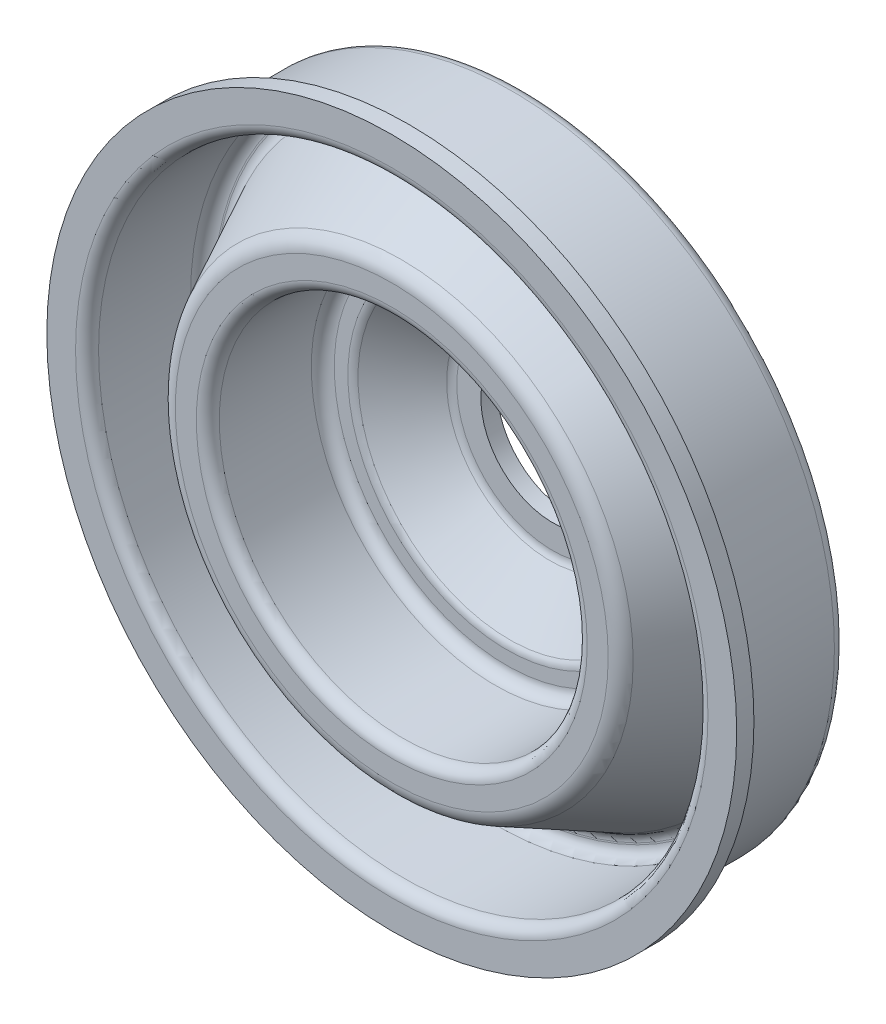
ISO-10303-21;
HEADER;
FILE_DESCRIPTION(('STEP AP214'),'2;1');
FILE_NAME('part.step','',(''),(''),'','','');
FILE_SCHEMA(('AUTOMOTIVE_DESIGN { 1 0 10303 214 1 1 1 1 }'));
ENDSEC;
DATA;
#1=APPLICATION_CONTEXT('core data for automotive mechanical design processes');
#2=APPLICATION_PROTOCOL_DEFINITION('international standard','automotive_design',2000,#1);
#3=PRODUCT_CONTEXT('',#1,'mechanical');
#4=PRODUCT('Part','Part','',(#3));
#5=PRODUCT_RELATED_PRODUCT_CATEGORY('part','',(#4));
#6=PRODUCT_DEFINITION_FORMATION('','',#4);
#7=PRODUCT_DEFINITION_CONTEXT('part definition',#1,'design');
#8=PRODUCT_DEFINITION('design','',#6,#7);
#9=PRODUCT_DEFINITION_SHAPE('','',#8);
#10=(LENGTH_UNIT() NAMED_UNIT(*) SI_UNIT(.MILLI.,.METRE.));
#11=(NAMED_UNIT(*) PLANE_ANGLE_UNIT() SI_UNIT($,.RADIAN.));
#12=(NAMED_UNIT(*) SI_UNIT($,.STERADIAN.) SOLID_ANGLE_UNIT());
#13=UNCERTAINTY_MEASURE_WITH_UNIT(LENGTH_MEASURE(1.E-05),#10,'distance_accuracy_value','');
#14=(GEOMETRIC_REPRESENTATION_CONTEXT(3) GLOBAL_UNCERTAINTY_ASSIGNED_CONTEXT((#13)) GLOBAL_UNIT_ASSIGNED_CONTEXT((#10,
#11,#12)) REPRESENTATION_CONTEXT('',''));
#15=CARTESIAN_POINT('',(0.,0.,0.));
#16=DIRECTION('',(0.,0.,1.));
#17=DIRECTION('',(1.,0.,0.));
#18=AXIS2_PLACEMENT_3D('',#15,#16,#17);
#19=CARTESIAN_POINT('',(-2.4980018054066E-13,0.,1.41870515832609));
#20=DIRECTION('',(0.,0.,0.999999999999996));
#21=DIRECTION('',(1.,0.,0.));
#22=AXIS2_PLACEMENT_3D('',#19,#20,#21);
#23=CYLINDRICAL_SURFACE('',#22,16.);
#24=CARTESIAN_POINT('',(0.,8.88178419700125E-13,14.4187046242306));
#25=DIRECTION('',(0.,0.,0.999999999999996));
#26=DIRECTION('',(1.,0.,0.));
#27=AXIS2_PLACEMENT_3D('',#24,#25,#26);
#28=CIRCLE('',#27,16.);
#29=CARTESIAN_POINT('',(15.9999999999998,0.,14.4187046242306));
#30=VERTEX_POINT('',#29);
#31=EDGE_CURVE('E10',#30,#30,#28,.T.);
#32=CARTESIAN_POINT('',(0.,0.,6.41870462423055));
#33=DIRECTION('',(0.,0.,0.999999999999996));
#34=DIRECTION('',(1.,0.,0.));
#35=AXIS2_PLACEMENT_3D('',#32,#33,#34);
#36=CIRCLE('',#35,16.);
#37=CARTESIAN_POINT('',(15.9999999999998,0.,6.41870462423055));
#38=VERTEX_POINT('',#37);
#39=EDGE_CURVE('E169',#38,#38,#36,.T.);
#40=CARTESIAN_POINT('',(15.9999999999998,0.,14.4187046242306));
#41=CARTESIAN_POINT('',(15.9999999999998,0.,14.3353712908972));
#42=CARTESIAN_POINT('',(15.9999999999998,0.,14.2520379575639));
#43=CARTESIAN_POINT('',(15.9999999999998,0.,14.0853712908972));
#44=CARTESIAN_POINT('',(15.9999999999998,0.,14.0020379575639));
#45=CARTESIAN_POINT('',(15.9999999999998,0.,13.8353712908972));
#46=CARTESIAN_POINT('',(15.9999999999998,0.,13.7520379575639));
#47=CARTESIAN_POINT('',(15.9999999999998,0.,13.5853712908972));
#48=CARTESIAN_POINT('',(15.9999999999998,0.,13.5020379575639));
#49=CARTESIAN_POINT('',(15.9999999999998,0.,13.3353712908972));
#50=CARTESIAN_POINT('',(15.9999999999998,0.,13.2520379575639));
#51=CARTESIAN_POINT('',(15.9999999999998,0.,13.0853712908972));
#52=CARTESIAN_POINT('',(15.9999999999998,0.,13.0020379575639));
#53=CARTESIAN_POINT('',(15.9999999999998,0.,12.8353712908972));
#54=CARTESIAN_POINT('',(15.9999999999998,0.,12.7520379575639));
#55=CARTESIAN_POINT('',(15.9999999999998,0.,12.5853712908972));
#56=CARTESIAN_POINT('',(15.9999999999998,0.,12.5020379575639));
#57=CARTESIAN_POINT('',(15.9999999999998,0.,12.3353712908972));
#58=CARTESIAN_POINT('',(15.9999999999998,0.,12.2520379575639));
#59=CARTESIAN_POINT('',(15.9999999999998,0.,12.0853712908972));
#60=CARTESIAN_POINT('',(15.9999999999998,0.,12.0020379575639));
#61=CARTESIAN_POINT('',(15.9999999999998,0.,11.8353712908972));
#62=CARTESIAN_POINT('',(15.9999999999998,0.,11.7520379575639));
#63=CARTESIAN_POINT('',(15.9999999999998,0.,11.5853712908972));
#64=CARTESIAN_POINT('',(15.9999999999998,0.,11.5020379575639));
#65=CARTESIAN_POINT('',(15.9999999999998,0.,11.3353712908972));
#66=CARTESIAN_POINT('',(15.9999999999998,0.,11.2520379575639));
#67=CARTESIAN_POINT('',(15.9999999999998,0.,11.0853712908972));
#68=CARTESIAN_POINT('',(15.9999999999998,0.,11.0020379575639));
#69=CARTESIAN_POINT('',(15.9999999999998,0.,10.8353712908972));
#70=CARTESIAN_POINT('',(15.9999999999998,0.,10.7520379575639));
#71=CARTESIAN_POINT('',(15.9999999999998,0.,10.5853712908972));
#72=CARTESIAN_POINT('',(15.9999999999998,0.,10.5020379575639));
#73=CARTESIAN_POINT('',(15.9999999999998,0.,10.3353712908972));
#74=CARTESIAN_POINT('',(15.9999999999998,0.,10.2520379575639));
#75=CARTESIAN_POINT('',(15.9999999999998,0.,10.0853712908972));
#76=CARTESIAN_POINT('',(15.9999999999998,0.,10.0020379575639));
#77=CARTESIAN_POINT('',(15.9999999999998,0.,9.83537129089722));
#78=CARTESIAN_POINT('',(15.9999999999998,0.,9.75203795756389));
#79=CARTESIAN_POINT('',(15.9999999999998,0.,9.58537129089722));
#80=CARTESIAN_POINT('',(15.9999999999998,0.,9.50203795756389));
#81=CARTESIAN_POINT('',(15.9999999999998,0.,9.33537129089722));
#82=CARTESIAN_POINT('',(15.9999999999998,0.,9.25203795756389));
#83=CARTESIAN_POINT('',(15.9999999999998,0.,9.08537129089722));
#84=CARTESIAN_POINT('',(15.9999999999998,0.,9.00203795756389));
#85=CARTESIAN_POINT('',(15.9999999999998,0.,8.83537129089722));
#86=CARTESIAN_POINT('',(15.9999999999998,0.,8.75203795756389));
#87=CARTESIAN_POINT('',(15.9999999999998,0.,8.58537129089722));
#88=CARTESIAN_POINT('',(15.9999999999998,0.,8.50203795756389));
#89=CARTESIAN_POINT('',(15.9999999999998,0.,8.33537129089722));
#90=CARTESIAN_POINT('',(15.9999999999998,0.,8.25203795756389));
#91=CARTESIAN_POINT('',(15.9999999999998,0.,8.08537129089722));
#92=CARTESIAN_POINT('',(15.9999999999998,0.,8.00203795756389));
#93=CARTESIAN_POINT('',(15.9999999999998,0.,7.83537129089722));
#94=CARTESIAN_POINT('',(15.9999999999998,0.,7.75203795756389));
#95=CARTESIAN_POINT('',(15.9999999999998,0.,7.58537129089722));
#96=CARTESIAN_POINT('',(15.9999999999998,0.,7.50203795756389));
#97=CARTESIAN_POINT('',(15.9999999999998,0.,7.33537129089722));
#98=CARTESIAN_POINT('',(15.9999999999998,0.,7.25203795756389));
#99=CARTESIAN_POINT('',(15.9999999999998,0.,7.08537129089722));
#100=CARTESIAN_POINT('',(15.9999999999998,0.,7.00203795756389));
#101=CARTESIAN_POINT('',(15.9999999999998,0.,6.83537129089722));
#102=CARTESIAN_POINT('',(15.9999999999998,0.,6.75203795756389));
#103=CARTESIAN_POINT('',(15.9999999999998,0.,6.58537129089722));
#104=CARTESIAN_POINT('',(15.9999999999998,0.,6.50203795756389));
#105=CARTESIAN_POINT('',(15.9999999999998,0.,6.41870462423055));
#106=B_SPLINE_CURVE_WITH_KNOTS('',3,(#40,#41,#42,#43,#44,#45,#46,#47,#48,#49,#50,#51,#52,#53,
#54,#55,#56,#57,#58,#59,#60,#61,#62,#63,#64,#65,#66,#67,#68,#69,#70,#71,#72,#73,#74,#75,#76,#77,
#78,#79,#80,#81,#82,#83,#84,#85,#86,#87,#88,#89,#90,#91,#92,#93,#94,#95,#96,#97,#98,#99,#100,
#101,#102,#103,#104,#105),.UNSPECIFIED.,.F.,.F.,(4,2,2,2,2,2,2,2,2,2,2,2,2,2,2,2,2,2,2,2,2,2,2,
2,2,2,2,2,2,2,2,2,4),(0.,0.25,0.5,0.750000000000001,0.999999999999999,1.25,1.5,1.75,2.,2.25,2.5,
2.75,3.,3.25,3.5,3.75,4.,4.25,4.5,4.75000000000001,5.,5.25,5.50000000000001,5.75,6.,
6.25000000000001,6.50000000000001,6.75000000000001,7.,7.25,7.50000000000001,7.75000000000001,
8.00000000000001),.UNSPECIFIED.);
#107=EDGE_CURVE('BSEAM34',#30,#38,#106,.T.);
#108=ORIENTED_EDGE('',*,*,#31,.T.);
#109=ORIENTED_EDGE('',*,*,#39,.F.);
#110=ORIENTED_EDGE('',*,*,#107,.T.);
#111=ORIENTED_EDGE('',*,*,#107,.F.);
#112=EDGE_LOOP('',(#108,#110,#109,#111));
#113=FACE_BOUND('',#112,.T.);
#114=ADVANCED_FACE('F34',(#113),#23,.F.);
#115=CARTESIAN_POINT('',(0.,8.88178419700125E-13,14.4187046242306));
#116=DIRECTION('',(0.,0.,0.999999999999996));
#117=DIRECTION('',(1.,0.,0.));
#118=AXIS2_PLACEMENT_3D('',#115,#116,#117);
#119=TOROIDAL_SURFACE('',#118,17.,1.);
#120=CARTESIAN_POINT('',(0.,8.88178419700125E-13,15.4187046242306));
#121=DIRECTION('',(0.,0.,0.999999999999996));
#122=DIRECTION('',(1.,0.,0.));
#123=AXIS2_PLACEMENT_3D('',#120,#121,#122);
#124=CIRCLE('',#123,17.);
#125=CARTESIAN_POINT('',(17.,8.87234730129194E-13,15.4187046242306));
#126=VERTEX_POINT('',#125);
#127=EDGE_CURVE('E41',#126,#126,#124,.T.);
#128=ORIENTED_EDGE('',*,*,#127,.T.);
#129=EDGE_LOOP('',(#128));
#130=FACE_BOUND('',#129,.T.);
#131=ORIENTED_EDGE('',*,*,#31,.F.);
#132=EDGE_LOOP('',(#131));
#133=FACE_BOUND('',#132,.T.);
#134=ADVANCED_FACE('F177',(#130,#133),#119,.T.);
#135=CARTESIAN_POINT('',(-6.52256026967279E-13,-4.07924355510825,15.4187046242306));
#136=DIRECTION('',(0.,0.,0.999999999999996));
#137=DIRECTION('',(1.,0.,0.));
#138=AXIS2_PLACEMENT_3D('',#135,#136,#137);
#139=PLANE('',#138);
#140=CARTESIAN_POINT('',(0.,8.88178419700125E-13,15.4187046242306));
#141=DIRECTION('',(0.,0.,0.999999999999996));
#142=DIRECTION('',(1.,0.,0.));
#143=AXIS2_PLACEMENT_3D('',#140,#141,#142);
#144=CIRCLE('',#143,18.825);
#145=CARTESIAN_POINT('',(18.825,8.87133422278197E-13,15.4187046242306));
#146=VERTEX_POINT('',#145);
#147=EDGE_CURVE('E48',#146,#146,#144,.T.);
#148=ORIENTED_EDGE('',*,*,#147,.T.);
#149=EDGE_LOOP('',(#148));
#150=FACE_BOUND('',#149,.T.);
#151=ORIENTED_EDGE('',*,*,#127,.F.);
#152=EDGE_LOOP('',(#151));
#153=FACE_BOUND('',#152,.T.);
#154=ADVANCED_FACE('F181',(#150,#153),#139,.T.);
#155=CARTESIAN_POINT('',(0.,8.88178419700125E-13,13.9187046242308));
#156=DIRECTION('',(0.,0.,0.999999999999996));
#157=DIRECTION('',(1.,0.,0.));
#158=AXIS2_PLACEMENT_3D('',#155,#156,#157);
#159=TOROIDAL_SURFACE('',#158,18.825,1.49999999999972);
#160=CARTESIAN_POINT('',(0.,8.88178419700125E-13,14.5895249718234));
#161=DIRECTION('',(0.,0.,0.999999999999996));
#162=DIRECTION('',(1.,0.,0.));
#163=AXIS2_PLACEMENT_3D('',#160,#161,#162);
#164=CIRCLE('',#163,20.1666408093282);
#165=CARTESIAN_POINT('',(-20.1666408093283,0.,14.5895249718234));
#166=VERTEX_POINT('',#165);
#167=EDGE_CURVE('E54',#166,#166,#164,.T.);
#168=ORIENTED_EDGE('',*,*,#167,.T.);
#169=EDGE_LOOP('',(#168));
#170=FACE_BOUND('',#169,.T.);
#171=ORIENTED_EDGE('',*,*,#147,.F.);
#172=EDGE_LOOP('',(#171));
#173=FACE_BOUND('',#172,.T.);
#174=ADVANCED_FACE('F185',(#170,#173),#159,.T.);
#175=CARTESIAN_POINT('',(0.,0.,5.97149105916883));
#176=DIRECTION('',(0.,0.,-0.999999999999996));
#177=DIRECTION('',(-1.,0.,0.));
#178=AXIS2_PLACEMENT_3D('',#175,#176,#177);
#179=CONICAL_SURFACE('',#178,24.4756573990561,0.463647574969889);
#180=CARTESIAN_POINT('',(0.,0.,5.97149105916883));
#181=DIRECTION('',(0.,0.,0.999999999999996));
#182=DIRECTION('',(1.,0.,0.));
#183=AXIS2_PLACEMENT_3D('',#180,#181,#182);
#184=CIRCLE('',#183,24.4756573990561);
#185=CARTESIAN_POINT('',(-24.4756573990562,0.,5.97149105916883));
#186=VERTEX_POINT('',#185);
#187=EDGE_CURVE('E59',#186,#186,#184,.T.);
#188=CARTESIAN_POINT('',(-20.1666408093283,0.,14.5895249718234));
#189=CARTESIAN_POINT('',(-20.2115263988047,0.,14.4997537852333));
#190=CARTESIAN_POINT('',(-20.256411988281,0.,14.4099825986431));
#191=CARTESIAN_POINT('',(-20.3461831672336,0.,14.2304402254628));
#192=CARTESIAN_POINT('',(-20.39106875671,0.,14.1406690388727));
#193=CARTESIAN_POINT('',(-20.4808399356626,0.,13.9611266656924));
#194=CARTESIAN_POINT('',(-20.525725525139,0.,13.8713554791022));
#195=CARTESIAN_POINT('',(-20.6154967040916,0.,13.6918131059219));
#196=CARTESIAN_POINT('',(-20.660382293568,0.,13.6020419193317));
#197=CARTESIAN_POINT('',(-20.7501534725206,0.,13.4224995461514));
#198=CARTESIAN_POINT('',(-20.795039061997,0.,13.3327283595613));
#199=CARTESIAN_POINT('',(-20.8848102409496,0.,13.153185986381));
#200=CARTESIAN_POINT('',(-20.929695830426,0.,13.0634147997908));
#201=CARTESIAN_POINT('',(-21.0194670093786,0.,12.8838724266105));
#202=CARTESIAN_POINT('',(-21.064352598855,0.,12.7941012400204));
#203=CARTESIAN_POINT('',(-21.1541237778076,0.,12.6145588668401));
#204=CARTESIAN_POINT('',(-21.199009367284,0.,12.5247876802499));
#205=CARTESIAN_POINT('',(-21.2887805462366,0.,12.3452453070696));
#206=CARTESIAN_POINT('',(-21.3336661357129,0.,12.2554741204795));
#207=CARTESIAN_POINT('',(-21.4234373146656,0.,12.0759317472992));
#208=CARTESIAN_POINT('',(-21.4683229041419,0.,11.986160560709));
#209=CARTESIAN_POINT('',(-21.5580940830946,0.,11.8066181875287));
#210=CARTESIAN_POINT('',(-21.6029796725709,0.,11.7168470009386));
#211=CARTESIAN_POINT('',(-21.6927508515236,0.,11.5373046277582));
#212=CARTESIAN_POINT('',(-21.7376364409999,0.,11.4475334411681));
#213=CARTESIAN_POINT('',(-21.8274076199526,0.,11.2679910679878));
#214=CARTESIAN_POINT('',(-21.8722932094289,0.,11.1782198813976));
#215=CARTESIAN_POINT('',(-21.9620643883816,0.,10.9986775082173));
#216=CARTESIAN_POINT('',(-22.0069499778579,0.,10.9089063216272));
#217=CARTESIAN_POINT('',(-22.0967211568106,0.,10.7293639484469));
#218=CARTESIAN_POINT('',(-22.1416067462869,0.,10.6395927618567));
#219=CARTESIAN_POINT('',(-22.2313779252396,0.,10.4600503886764));
#220=CARTESIAN_POINT('',(-22.2762635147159,0.,10.3702792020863));
#221=CARTESIAN_POINT('',(-22.3660346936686,0.,10.190736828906));
#222=CARTESIAN_POINT('',(-22.4109202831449,0.,10.1009656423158));
#223=CARTESIAN_POINT('',(-22.5006914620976,0.,9.92142326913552));
#224=CARTESIAN_POINT('',(-22.5455770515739,0.,9.83165208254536));
#225=CARTESIAN_POINT('',(-22.6353482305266,0.,9.65210970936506));
#226=CARTESIAN_POINT('',(-22.6802338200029,0.,9.56233852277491));
#227=CARTESIAN_POINT('',(-22.7700049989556,0.,9.3827961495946));
#228=CARTESIAN_POINT('',(-22.8148905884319,0.,9.29302496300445));
#229=CARTESIAN_POINT('',(-22.9046617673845,0.,9.11348258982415));
#230=CARTESIAN_POINT('',(-22.9495473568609,0.,9.023711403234));
#231=CARTESIAN_POINT('',(-23.0393185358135,0.,8.84416903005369));
#232=CARTESIAN_POINT('',(-23.0842041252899,0.,8.75439784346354));
#233=CARTESIAN_POINT('',(-23.1739753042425,0.,8.57485547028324));
#234=CARTESIAN_POINT('',(-23.2188608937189,0.,8.48508428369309));
#235=CARTESIAN_POINT('',(-23.3086320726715,0.,8.30554191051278));
#236=CARTESIAN_POINT('',(-23.3535176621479,0.,8.21577072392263));
#237=CARTESIAN_POINT('',(-23.4432888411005,0.,8.03622835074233));
#238=CARTESIAN_POINT('',(-23.4881744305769,0.,7.94645716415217));
#239=CARTESIAN_POINT('',(-23.5779456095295,0.,7.76691479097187));
#240=CARTESIAN_POINT('',(-23.6228311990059,0.,7.67714360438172));
#241=CARTESIAN_POINT('',(-23.7126023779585,0.,7.49760123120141));
#242=CARTESIAN_POINT('',(-23.7574879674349,0.,7.40783004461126));
#243=CARTESIAN_POINT('',(-23.8472591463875,0.,7.22828767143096));
#244=CARTESIAN_POINT('',(-23.8921447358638,0.,7.13851648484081));
#245=CARTESIAN_POINT('',(-23.9819159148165,0.,6.9589741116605));
#246=CARTESIAN_POINT('',(-24.0268015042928,0.,6.86920292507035));
#247=CARTESIAN_POINT('',(-24.1165726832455,0.,6.68966055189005));
#248=CARTESIAN_POINT('',(-24.1614582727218,0.,6.59988936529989));
#249=CARTESIAN_POINT('',(-24.2512294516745,0.,6.42034699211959));
#250=CARTESIAN_POINT('',(-24.2961150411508,0.,6.33057580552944));
#251=CARTESIAN_POINT('',(-24.3858862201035,0.,6.15103343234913));
#252=CARTESIAN_POINT('',(-24.4307718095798,0.,6.06126224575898));
#253=CARTESIAN_POINT('',(-24.4756573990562,0.,5.97149105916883));
#254=B_SPLINE_CURVE_WITH_KNOTS('',3,(#188,#189,#190,#191,#192,#193,#194,#195,#196,#197,#198,
#199,#200,#201,#202,#203,#204,#205,#206,#207,#208,#209,#210,#211,#212,#213,#214,#215,#216,#217,
#218,#219,#220,#221,#222,#223,#224,#225,#226,#227,#228,#229,#230,#231,#232,#233,#234,#235,#236,
#237,#238,#239,#240,#241,#242,#243,#244,#245,#246,#247,#248,#249,#250,#251,#252,#253),
.UNSPECIFIED.,.F.,.F.,(4,2,2,2,2,2,2,2,2,2,2,2,2,2,2,2,2,2,2,2,2,2,2,2,2,2,2,2,2,2,2,2,4),(0.,
0.301101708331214,0.602203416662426,0.90330512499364,1.20440683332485,1.50550854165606,
1.80661024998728,2.10771195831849,2.40881366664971,2.70991537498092,3.01101708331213,
3.31211879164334,3.61322049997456,3.91432220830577,4.21542391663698,4.5165256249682,
4.81762733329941,5.11872904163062,5.41983074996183,5.72093245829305,6.02203416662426,
6.32313587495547,6.62423758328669,6.9253392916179,7.22644099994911,7.52754270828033,
7.82864441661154,8.12974612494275,8.43084783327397,8.73194954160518,9.03305124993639,
9.3341529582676,9.63525466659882),.UNSPECIFIED.);
#255=EDGE_CURVE('BSEAM192',#166,#186,#254,.T.);
#256=ORIENTED_EDGE('',*,*,#167,.F.);
#257=ORIENTED_EDGE('',*,*,#187,.T.);
#258=ORIENTED_EDGE('',*,*,#255,.T.);
#259=ORIENTED_EDGE('',*,*,#255,.F.);
#260=EDGE_LOOP('',(#256,#258,#257,#259));
#261=FACE_BOUND('',#260,.T.);
#262=ADVANCED_FACE('F192',(#261),#179,.T.);
#263=CARTESIAN_POINT('',(0.,0.,6.41870462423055));
#264=DIRECTION('',(0.,0.,0.999999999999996));
#265=DIRECTION('',(1.,0.,0.));
#266=AXIS2_PLACEMENT_3D('',#263,#264,#265);
#267=TOROIDAL_SURFACE('',#266,25.3700846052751,1.);
#268=ORIENTED_EDGE('',*,*,#187,.F.);
#269=EDGE_LOOP('',(#268));
#270=FACE_BOUND('',#269,.T.);
#271=CARTESIAN_POINT('',(0.,0.,5.41870462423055));
#272=DIRECTION('',(0.,0.,0.999999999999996));
#273=DIRECTION('',(1.,0.,0.));
#274=AXIS2_PLACEMENT_3D('',#271,#272,#273);
#275=CIRCLE('',#274,25.3700846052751);
#276=CARTESIAN_POINT('',(25.3700846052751,0.,5.41870462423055));
#277=VERTEX_POINT('',#276);
#278=EDGE_CURVE('E63',#277,#277,#275,.T.);
#279=ORIENTED_EDGE('',*,*,#278,.T.);
#280=EDGE_LOOP('',(#279));
#281=FACE_BOUND('',#280,.T.);
#282=ADVANCED_FACE('F196',(#270,#281),#267,.F.);
#283=CARTESIAN_POINT('',(-6.80011602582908E-13,-4.07924355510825,5.41870462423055));
#284=DIRECTION('',(0.,0.,0.999999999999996));
#285=DIRECTION('',(1.,0.,0.));
#286=AXIS2_PLACEMENT_3D('',#283,#284,#285);
#287=PLANE('',#286);
#288=CARTESIAN_POINT('',(0.,0.,5.41870462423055));
#289=DIRECTION('',(0.,0.,0.999999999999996));
#290=DIRECTION('',(1.,0.,0.));
#291=AXIS2_PLACEMENT_3D('',#288,#289,#290);
#292=CIRCLE('',#291,25.5);
#293=CARTESIAN_POINT('',(25.5000000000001,0.,5.41870462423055));
#294=VERTEX_POINT('',#293);
#295=EDGE_CURVE('E67',#294,#294,#292,.T.);
#296=ORIENTED_EDGE('',*,*,#295,.T.);
#297=EDGE_LOOP('',(#296));
#298=FACE_BOUND('',#297,.T.);
#299=ORIENTED_EDGE('',*,*,#278,.F.);
#300=EDGE_LOOP('',(#299));
#301=FACE_BOUND('',#300,.T.);
#302=ADVANCED_FACE('F200',(#298,#301),#287,.T.);
#303=CARTESIAN_POINT('',(0.,0.,6.41870462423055));
#304=DIRECTION('',(0.,0.,0.999999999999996));
#305=DIRECTION('',(1.,0.,0.));
#306=AXIS2_PLACEMENT_3D('',#303,#304,#305);
#307=TOROIDAL_SURFACE('',#306,25.5,1.);
#308=ORIENTED_EDGE('',*,*,#295,.F.);
#309=EDGE_LOOP('',(#308));
#310=FACE_BOUND('',#309,.T.);
#311=CARTESIAN_POINT('',(0.,0.,6.41870462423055));
#312=DIRECTION('',(0.,0.,0.999999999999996));
#313=DIRECTION('',(1.,0.,0.));
#314=AXIS2_PLACEMENT_3D('',#311,#312,#313);
#315=CIRCLE('',#314,26.5);
#316=CARTESIAN_POINT('',(26.4999999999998,0.,6.41870462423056));
#317=VERTEX_POINT('',#316);
#318=EDGE_CURVE('E71',#317,#317,#315,.T.);
#319=ORIENTED_EDGE('',*,*,#318,.T.);
#320=EDGE_LOOP('',(#319));
#321=FACE_BOUND('',#320,.T.);
#322=ADVANCED_FACE('F204',(#310,#321),#307,.F.);
#323=CARTESIAN_POINT('',(-2.4980018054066E-13,0.,1.41870515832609));
#324=DIRECTION('',(0.,0.,0.999999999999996));
#325=DIRECTION('',(1.,0.,0.));
#326=AXIS2_PLACEMENT_3D('',#323,#324,#325);
#327=CYLINDRICAL_SURFACE('',#326,26.5);
#328=CARTESIAN_POINT('',(0.,8.88178419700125E-13,14.4187046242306));
#329=DIRECTION('',(0.,0.,0.999999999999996));
#330=DIRECTION('',(1.,0.,0.));
#331=AXIS2_PLACEMENT_3D('',#328,#329,#330);
#332=CIRCLE('',#331,26.5);
#333=CARTESIAN_POINT('',(26.4999999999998,0.,14.4187046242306));
#334=VERTEX_POINT('',#333);
#335=EDGE_CURVE('E75',#334,#334,#332,.T.);
#336=CARTESIAN_POINT('',(26.4999999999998,0.,6.41870462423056));
#337=CARTESIAN_POINT('',(26.4999999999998,0.,6.50203795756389));
#338=CARTESIAN_POINT('',(26.4999999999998,0.,6.58537129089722));
#339=CARTESIAN_POINT('',(26.4999999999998,0.,6.75203795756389));
#340=CARTESIAN_POINT('',(26.4999999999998,0.,6.83537129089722));
#341=CARTESIAN_POINT('',(26.4999999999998,0.,7.00203795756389));
#342=CARTESIAN_POINT('',(26.4999999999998,0.,7.08537129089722));
#343=CARTESIAN_POINT('',(26.4999999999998,0.,7.25203795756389));
#344=CARTESIAN_POINT('',(26.4999999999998,0.,7.33537129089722));
#345=CARTESIAN_POINT('',(26.4999999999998,0.,7.50203795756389));
#346=CARTESIAN_POINT('',(26.4999999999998,0.,7.58537129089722));
#347=CARTESIAN_POINT('',(26.4999999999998,0.,7.75203795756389));
#348=CARTESIAN_POINT('',(26.4999999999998,0.,7.83537129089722));
#349=CARTESIAN_POINT('',(26.4999999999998,0.,8.00203795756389));
#350=CARTESIAN_POINT('',(26.4999999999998,0.,8.08537129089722));
#351=CARTESIAN_POINT('',(26.4999999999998,0.,8.25203795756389));
#352=CARTESIAN_POINT('',(26.4999999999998,0.,8.33537129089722));
#353=CARTESIAN_POINT('',(26.4999999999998,0.,8.50203795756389));
#354=CARTESIAN_POINT('',(26.4999999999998,0.,8.58537129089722));
#355=CARTESIAN_POINT('',(26.4999999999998,0.,8.75203795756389));
#356=CARTESIAN_POINT('',(26.4999999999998,0.,8.83537129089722));
#357=CARTESIAN_POINT('',(26.4999999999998,0.,9.00203795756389));
#358=CARTESIAN_POINT('',(26.4999999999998,0.,9.08537129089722));
#359=CARTESIAN_POINT('',(26.4999999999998,0.,9.25203795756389));
#360=CARTESIAN_POINT('',(26.4999999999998,0.,9.33537129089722));
#361=CARTESIAN_POINT('',(26.4999999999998,0.,9.50203795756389));
#362=CARTESIAN_POINT('',(26.4999999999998,0.,9.58537129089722));
#363=CARTESIAN_POINT('',(26.4999999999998,0.,9.75203795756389));
#364=CARTESIAN_POINT('',(26.4999999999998,0.,9.83537129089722));
#365=CARTESIAN_POINT('',(26.4999999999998,0.,10.0020379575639));
#366=CARTESIAN_POINT('',(26.4999999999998,0.,10.0853712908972));
#367=CARTESIAN_POINT('',(26.4999999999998,0.,10.2520379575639));
#368=CARTESIAN_POINT('',(26.4999999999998,0.,10.3353712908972));
#369=CARTESIAN_POINT('',(26.4999999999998,0.,10.5020379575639));
#370=CARTESIAN_POINT('',(26.4999999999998,0.,10.5853712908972));
#371=CARTESIAN_POINT('',(26.4999999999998,0.,10.7520379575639));
#372=CARTESIAN_POINT('',(26.4999999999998,0.,10.8353712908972));
#373=CARTESIAN_POINT('',(26.4999999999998,0.,11.0020379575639));
#374=CARTESIAN_POINT('',(26.4999999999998,0.,11.0853712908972));
#375=CARTESIAN_POINT('',(26.4999999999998,0.,11.2520379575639));
#376=CARTESIAN_POINT('',(26.4999999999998,0.,11.3353712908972));
#377=CARTESIAN_POINT('',(26.4999999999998,0.,11.5020379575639));
#378=CARTESIAN_POINT('',(26.4999999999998,0.,11.5853712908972));
#379=CARTESIAN_POINT('',(26.4999999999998,0.,11.7520379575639));
#380=CARTESIAN_POINT('',(26.4999999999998,0.,11.8353712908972));
#381=CARTESIAN_POINT('',(26.4999999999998,0.,12.0020379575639));
#382=CARTESIAN_POINT('',(26.4999999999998,0.,12.0853712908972));
#383=CARTESIAN_POINT('',(26.4999999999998,0.,12.2520379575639));
#384=CARTESIAN_POINT('',(26.4999999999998,0.,12.3353712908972));
#385=CARTESIAN_POINT('',(26.4999999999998,0.,12.5020379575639));
#386=CARTESIAN_POINT('',(26.4999999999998,0.,12.5853712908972));
#387=CARTESIAN_POINT('',(26.4999999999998,0.,12.7520379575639));
#388=CARTESIAN_POINT('',(26.4999999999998,0.,12.8353712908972));
#389=CARTESIAN_POINT('',(26.4999999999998,0.,13.0020379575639));
#390=CARTESIAN_POINT('',(26.4999999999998,0.,13.0853712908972));
#391=CARTESIAN_POINT('',(26.4999999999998,0.,13.2520379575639));
#392=CARTESIAN_POINT('',(26.4999999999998,0.,13.3353712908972));
#393=CARTESIAN_POINT('',(26.4999999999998,0.,13.5020379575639));
#394=CARTESIAN_POINT('',(26.4999999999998,0.,13.5853712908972));
#395=CARTESIAN_POINT('',(26.4999999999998,0.,13.7520379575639));
#396=CARTESIAN_POINT('',(26.4999999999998,0.,13.8353712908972));
#397=CARTESIAN_POINT('',(26.4999999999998,0.,14.0020379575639));
#398=CARTESIAN_POINT('',(26.4999999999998,0.,14.0853712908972));
#399=CARTESIAN_POINT('',(26.4999999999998,0.,14.2520379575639));
#400=CARTESIAN_POINT('',(26.4999999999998,0.,14.3353712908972));
#401=CARTESIAN_POINT('',(26.4999999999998,0.,14.4187046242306));
#402=B_SPLINE_CURVE_WITH_KNOTS('',3,(#336,#337,#338,#339,#340,#341,#342,#343,#344,#345,#346,
#347,#348,#349,#350,#351,#352,#353,#354,#355,#356,#357,#358,#359,#360,#361,#362,#363,#364,#365,
#366,#367,#368,#369,#370,#371,#372,#373,#374,#375,#376,#377,#378,#379,#380,#381,#382,#383,#384,
#385,#386,#387,#388,#389,#390,#391,#392,#393,#394,#395,#396,#397,#398,#399,#400,#401),
.UNSPECIFIED.,.F.,.F.,(4,2,2,2,2,2,2,2,2,2,2,2,2,2,2,2,2,2,2,2,2,2,2,2,2,2,2,2,2,2,2,2,4),(0.,
0.25,0.5,0.750000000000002,1.,1.25,1.5,1.75,2.,2.25,2.5,2.75,3.,3.25,3.5,3.75,4.00000000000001,
4.25,4.50000000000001,4.75000000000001,5.,5.25000000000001,5.50000000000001,5.75000000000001,
6.00000000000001,6.25000000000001,6.50000000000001,6.75000000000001,7.00000000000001,
7.25000000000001,7.50000000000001,7.75000000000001,8.00000000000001),.UNSPECIFIED.);
#403=EDGE_CURVE('BSEAM208',#317,#334,#402,.T.);
#404=ORIENTED_EDGE('',*,*,#318,.F.);
#405=ORIENTED_EDGE('',*,*,#335,.T.);
#406=ORIENTED_EDGE('',*,*,#403,.T.);
#407=ORIENTED_EDGE('',*,*,#403,.F.);
#408=EDGE_LOOP('',(#404,#406,#405,#407));
#409=FACE_BOUND('',#408,.T.);
#410=ADVANCED_FACE('F208',(#409),#327,.F.);
#411=CARTESIAN_POINT('',(0.,8.88178419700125E-13,14.4187046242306));
#412=DIRECTION('',(0.,0.,0.999999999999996));
#413=DIRECTION('',(1.,0.,0.));
#414=AXIS2_PLACEMENT_3D('',#411,#412,#413);
#415=TOROIDAL_SURFACE('',#414,27.5,1.);
#416=CARTESIAN_POINT('',(0.,8.88178419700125E-13,15.4187046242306));
#417=DIRECTION('',(0.,0.,0.999999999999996));
#418=DIRECTION('',(1.,0.,0.));
#419=AXIS2_PLACEMENT_3D('',#416,#417,#418);
#420=CIRCLE('',#419,27.5);
#421=CARTESIAN_POINT('',(27.5,8.86651863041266E-13,15.4187046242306));
#422=VERTEX_POINT('',#421);
#423=EDGE_CURVE('E79',#422,#422,#420,.T.);
#424=ORIENTED_EDGE('',*,*,#423,.T.);
#425=EDGE_LOOP('',(#424));
#426=FACE_BOUND('',#425,.T.);
#427=ORIENTED_EDGE('',*,*,#335,.F.);
#428=EDGE_LOOP('',(#427));
#429=FACE_BOUND('',#428,.T.);
#430=ADVANCED_FACE('F212',(#426,#429),#415,.T.);
#431=CARTESIAN_POINT('',(-6.52256026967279E-13,-4.07924355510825,15.4187046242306));
#432=DIRECTION('',(0.,0.,0.999999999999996));
#433=DIRECTION('',(1.,0.,0.));
#434=AXIS2_PLACEMENT_3D('',#431,#432,#433);
#435=PLANE('',#434);
#436=CARTESIAN_POINT('',(0.,8.88178419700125E-13,15.4187046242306));
#437=DIRECTION('',(0.,0.,0.999999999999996));
#438=DIRECTION('',(1.,0.,0.));
#439=AXIS2_PLACEMENT_3D('',#436,#437,#438);
#440=CIRCLE('',#439,30.);
#441=CARTESIAN_POINT('',(29.9999999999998,0.,15.4187046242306));
#442=VERTEX_POINT('',#441);
#443=EDGE_CURVE('E83',#442,#442,#440,.T.);
#444=ORIENTED_EDGE('',*,*,#443,.T.);
#445=EDGE_LOOP('',(#444));
#446=FACE_BOUND('',#445,.T.);
#447=ORIENTED_EDGE('',*,*,#423,.F.);
#448=EDGE_LOOP('',(#447));
#449=FACE_BOUND('',#448,.T.);
#450=ADVANCED_FACE('F216',(#446,#449),#435,.T.);
#451=CARTESIAN_POINT('',(-2.4980018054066E-13,0.,1.41870515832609));
#452=DIRECTION('',(0.,0.,0.999999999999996));
#453=DIRECTION('',(1.,0.,0.));
#454=AXIS2_PLACEMENT_3D('',#451,#452,#453);
#455=CYLINDRICAL_SURFACE('',#454,30.);
#456=CARTESIAN_POINT('',(0.,8.88178419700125E-13,13.9187046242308));
#457=DIRECTION('',(0.,0.,0.999999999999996));
#458=DIRECTION('',(1.,0.,0.));
#459=AXIS2_PLACEMENT_3D('',#456,#457,#458);
#460=CIRCLE('',#459,30.);
#461=CARTESIAN_POINT('',(29.9999999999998,0.,13.9187046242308));
#462=VERTEX_POINT('',#461);
#463=EDGE_CURVE('E87',#462,#462,#460,.T.);
#464=CARTESIAN_POINT('',(29.9999999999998,0.,13.9187046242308));
#465=CARTESIAN_POINT('',(29.9999999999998,0.,13.9343296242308));
#466=CARTESIAN_POINT('',(29.9999999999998,0.,13.9499546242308));
#467=CARTESIAN_POINT('',(29.9999999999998,0.,13.9812046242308));
#468=CARTESIAN_POINT('',(29.9999999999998,0.,13.9968296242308));
#469=CARTESIAN_POINT('',(29.9999999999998,0.,14.0280796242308));
#470=CARTESIAN_POINT('',(29.9999999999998,0.,14.0437046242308));
#471=CARTESIAN_POINT('',(29.9999999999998,0.,14.0749546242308));
#472=CARTESIAN_POINT('',(29.9999999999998,0.,14.0905796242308));
#473=CARTESIAN_POINT('',(29.9999999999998,0.,14.1218296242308));
#474=CARTESIAN_POINT('',(29.9999999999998,0.,14.1374546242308));
#475=CARTESIAN_POINT('',(29.9999999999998,0.,14.1687046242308));
#476=CARTESIAN_POINT('',(29.9999999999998,0.,14.1843296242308));
#477=CARTESIAN_POINT('',(29.9999999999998,0.,14.2155796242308));
#478=CARTESIAN_POINT('',(29.9999999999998,0.,14.2312046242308));
#479=CARTESIAN_POINT('',(29.9999999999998,0.,14.2624546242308));
#480=CARTESIAN_POINT('',(29.9999999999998,0.,14.2780796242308));
#481=CARTESIAN_POINT('',(29.9999999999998,0.,14.3093296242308));
#482=CARTESIAN_POINT('',(29.9999999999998,0.,14.3249546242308));
#483=CARTESIAN_POINT('',(29.9999999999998,0.,14.3562046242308));
#484=CARTESIAN_POINT('',(29.9999999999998,0.,14.3718296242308));
#485=CARTESIAN_POINT('',(29.9999999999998,0.,14.4030796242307));
#486=CARTESIAN_POINT('',(29.9999999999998,0.,14.4187046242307));
#487=CARTESIAN_POINT('',(29.9999999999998,0.,14.4499546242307));
#488=CARTESIAN_POINT('',(29.9999999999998,0.,14.4655796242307));
#489=CARTESIAN_POINT('',(29.9999999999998,0.,14.4968296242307));
#490=CARTESIAN_POINT('',(29.9999999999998,0.,14.5124546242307));
#491=CARTESIAN_POINT('',(29.9999999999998,0.,14.5437046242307));
#492=CARTESIAN_POINT('',(29.9999999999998,0.,14.5593296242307));
#493=CARTESIAN_POINT('',(29.9999999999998,0.,14.5905796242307));
#494=CARTESIAN_POINT('',(29.9999999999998,0.,14.6062046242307));
#495=CARTESIAN_POINT('',(29.9999999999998,0.,14.6374546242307));
#496=CARTESIAN_POINT('',(29.9999999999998,0.,14.6530796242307));
#497=CARTESIAN_POINT('',(29.9999999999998,0.,14.6843296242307));
#498=CARTESIAN_POINT('',(29.9999999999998,0.,14.6999546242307));
#499=CARTESIAN_POINT('',(29.9999999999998,0.,14.7312046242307));
#500=CARTESIAN_POINT('',(29.9999999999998,0.,14.7468296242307));
#501=CARTESIAN_POINT('',(29.9999999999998,0.,14.7780796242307));
#502=CARTESIAN_POINT('',(29.9999999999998,0.,14.7937046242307));
#503=CARTESIAN_POINT('',(29.9999999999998,0.,14.8249546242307));
#504=CARTESIAN_POINT('',(29.9999999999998,0.,14.8405796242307));
#505=CARTESIAN_POINT('',(29.9999999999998,0.,14.8718296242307));
#506=CARTESIAN_POINT('',(29.9999999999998,0.,14.8874546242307));
#507=CARTESIAN_POINT('',(29.9999999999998,0.,14.9187046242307));
#508=CARTESIAN_POINT('',(29.9999999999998,0.,14.9343296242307));
#509=CARTESIAN_POINT('',(29.9999999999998,0.,14.9655796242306));
#510=CARTESIAN_POINT('',(29.9999999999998,0.,14.9812046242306));
#511=CARTESIAN_POINT('',(29.9999999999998,0.,15.0124546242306));
#512=CARTESIAN_POINT('',(29.9999999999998,0.,15.0280796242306));
#513=CARTESIAN_POINT('',(29.9999999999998,0.,15.0593296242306));
#514=CARTESIAN_POINT('',(29.9999999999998,0.,15.0749546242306));
#515=CARTESIAN_POINT('',(29.9999999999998,0.,15.1062046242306));
#516=CARTESIAN_POINT('',(29.9999999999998,0.,15.1218296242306));
#517=CARTESIAN_POINT('',(29.9999999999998,0.,15.1530796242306));
#518=CARTESIAN_POINT('',(29.9999999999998,0.,15.1687046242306));
#519=CARTESIAN_POINT('',(29.9999999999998,0.,15.1999546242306));
#520=CARTESIAN_POINT('',(29.9999999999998,0.,15.2155796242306));
#521=CARTESIAN_POINT('',(29.9999999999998,0.,15.2468296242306));
#522=CARTESIAN_POINT('',(29.9999999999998,0.,15.2624546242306));
#523=CARTESIAN_POINT('',(29.9999999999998,0.,15.2937046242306));
#524=CARTESIAN_POINT('',(29.9999999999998,0.,15.3093296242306));
#525=CARTESIAN_POINT('',(29.9999999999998,0.,15.3405796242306));
#526=CARTESIAN_POINT('',(29.9999999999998,0.,15.3562046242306));
#527=CARTESIAN_POINT('',(29.9999999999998,0.,15.3874546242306));
#528=CARTESIAN_POINT('',(29.9999999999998,0.,15.4030796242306));
#529=CARTESIAN_POINT('',(29.9999999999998,0.,15.4187046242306));
#530=B_SPLINE_CURVE_WITH_KNOTS('',3,(#464,#465,#466,#467,#468,#469,#470,#471,#472,#473,#474,
#475,#476,#477,#478,#479,#480,#481,#482,#483,#484,#485,#486,#487,#488,#489,#490,#491,#492,#493,
#494,#495,#496,#497,#498,#499,#500,#501,#502,#503,#504,#505,#506,#507,#508,#509,#510,#511,#512,
#513,#514,#515,#516,#517,#518,#519,#520,#521,#522,#523,#524,#525,#526,#527,#528,#529),
.UNSPECIFIED.,.F.,.F.,(4,2,2,2,2,2,2,2,2,2,2,2,2,2,2,2,2,2,2,2,2,2,2,2,2,2,2,2,2,2,2,2,4),(0.,
0.0468749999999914,0.0937499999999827,0.140624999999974,0.187499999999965,0.234374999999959,
0.28124999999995,0.328124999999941,0.374999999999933,0.421874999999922,0.468749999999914,
0.515624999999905,0.562499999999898,0.60937499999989,0.656249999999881,0.703124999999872,
0.749999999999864,0.796874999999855,0.843749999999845,0.890624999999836,0.937499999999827,
0.98437499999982,1.03124999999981,1.0781249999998,1.12499999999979,1.17187499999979,
1.21874999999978,1.26562499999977,1.31249999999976,1.35937499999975,1.40624999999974,
1.45312499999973,1.49999999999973),.UNSPECIFIED.);
#531=EDGE_CURVE('BSEAM220',#462,#442,#530,.T.);
#532=ORIENTED_EDGE('',*,*,#463,.T.);
#533=ORIENTED_EDGE('',*,*,#443,.F.);
#534=ORIENTED_EDGE('',*,*,#531,.T.);
#535=ORIENTED_EDGE('',*,*,#531,.F.);
#536=EDGE_LOOP('',(#532,#534,#533,#535));
#537=FACE_BOUND('',#536,.T.);
#538=ADVANCED_FACE('F220',(#537),#455,.T.);
#539=CARTESIAN_POINT('',(-6.80011602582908E-13,-4.07924355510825,13.9187046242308));
#540=DIRECTION('',(0.,0.,-0.999999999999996));
#541=DIRECTION('',(-1.,0.,0.));
#542=AXIS2_PLACEMENT_3D('',#539,#540,#541);
#543=PLANE('',#542);
#544=CARTESIAN_POINT('',(0.,8.88178419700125E-13,13.9187046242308));
#545=DIRECTION('',(0.,0.,0.999999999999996));
#546=DIRECTION('',(1.,0.,0.));
#547=AXIS2_PLACEMENT_3D('',#544,#545,#546);
#548=CIRCLE('',#547,28.);
#549=CARTESIAN_POINT('',(27.9999999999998,0.,13.9187046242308));
#550=VERTEX_POINT('',#549);
#551=EDGE_CURVE('E91',#550,#550,#548,.T.);
#552=ORIENTED_EDGE('',*,*,#551,.T.);
#553=EDGE_LOOP('',(#552));
#554=FACE_BOUND('',#553,.T.);
#555=ORIENTED_EDGE('',*,*,#463,.F.);
#556=EDGE_LOOP('',(#555));
#557=FACE_BOUND('',#556,.T.);
#558=ADVANCED_FACE('F224',(#554,#557),#543,.T.);
#559=CARTESIAN_POINT('',(-2.4980018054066E-13,0.,1.41870515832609));
#560=DIRECTION('',(0.,0.,0.999999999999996));
#561=DIRECTION('',(1.,0.,0.));
#562=AXIS2_PLACEMENT_3D('',#559,#560,#561);
#563=CYLINDRICAL_SURFACE('',#562,28.);
#564=CARTESIAN_POINT('',(0.,0.,4.91870462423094));
#565=DIRECTION('',(0.,0.,0.999999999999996));
#566=DIRECTION('',(1.,0.,0.));
#567=AXIS2_PLACEMENT_3D('',#564,#565,#566);
#568=CIRCLE('',#567,28.);
#569=CARTESIAN_POINT('',(27.9999999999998,0.,4.91870462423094));
#570=VERTEX_POINT('',#569);
#571=EDGE_CURVE('E95',#570,#570,#568,.T.);
#572=CARTESIAN_POINT('',(27.9999999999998,0.,4.91870462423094));
#573=CARTESIAN_POINT('',(27.9999999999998,0.,5.01245462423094));
#574=CARTESIAN_POINT('',(27.9999999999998,0.,5.10620462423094));
#575=CARTESIAN_POINT('',(27.9999999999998,0.,5.29370462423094));
#576=CARTESIAN_POINT('',(27.9999999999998,0.,5.38745462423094));
#577=CARTESIAN_POINT('',(27.9999999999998,0.,5.57495462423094));
#578=CARTESIAN_POINT('',(27.9999999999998,0.,5.66870462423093));
#579=CARTESIAN_POINT('',(27.9999999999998,0.,5.85620462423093));
#580=CARTESIAN_POINT('',(27.9999999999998,0.,5.94995462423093));
#581=CARTESIAN_POINT('',(27.9999999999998,0.,6.13745462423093));
#582=CARTESIAN_POINT('',(27.9999999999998,0.,6.23120462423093));
#583=CARTESIAN_POINT('',(27.9999999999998,0.,6.41870462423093));
#584=CARTESIAN_POINT('',(27.9999999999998,0.,6.51245462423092));
#585=CARTESIAN_POINT('',(27.9999999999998,0.,6.69995462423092));
#586=CARTESIAN_POINT('',(27.9999999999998,0.,6.79370462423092));
#587=CARTESIAN_POINT('',(27.9999999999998,0.,6.98120462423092));
#588=CARTESIAN_POINT('',(27.9999999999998,0.,7.07495462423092));
#589=CARTESIAN_POINT('',(27.9999999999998,0.,7.26245462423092));
#590=CARTESIAN_POINT('',(27.9999999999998,0.,7.35620462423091));
#591=CARTESIAN_POINT('',(27.9999999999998,0.,7.54370462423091));
#592=CARTESIAN_POINT('',(27.9999999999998,0.,7.63745462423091));
#593=CARTESIAN_POINT('',(27.9999999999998,0.,7.82495462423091));
#594=CARTESIAN_POINT('',(27.9999999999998,0.,7.91870462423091));
#595=CARTESIAN_POINT('',(27.9999999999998,0.,8.10620462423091));
#596=CARTESIAN_POINT('',(27.9999999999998,0.,8.19995462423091));
#597=CARTESIAN_POINT('',(27.9999999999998,0.,8.3874546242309));
#598=CARTESIAN_POINT('',(27.9999999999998,0.,8.4812046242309));
#599=CARTESIAN_POINT('',(27.9999999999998,0.,8.6687046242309));
#600=CARTESIAN_POINT('',(27.9999999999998,0.,8.7624546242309));
#601=CARTESIAN_POINT('',(27.9999999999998,0.,8.9499546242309));
#602=CARTESIAN_POINT('',(27.9999999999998,0.,9.0437046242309));
#603=CARTESIAN_POINT('',(27.9999999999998,0.,9.23120462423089));
#604=CARTESIAN_POINT('',(27.9999999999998,0.,9.32495462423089));
#605=CARTESIAN_POINT('',(27.9999999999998,0.,9.51245462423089));
#606=CARTESIAN_POINT('',(27.9999999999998,0.,9.60620462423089));
#607=CARTESIAN_POINT('',(27.9999999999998,0.,9.79370462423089));
#608=CARTESIAN_POINT('',(27.9999999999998,0.,9.88745462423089));
#609=CARTESIAN_POINT('',(27.9999999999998,0.,10.0749546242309));
#610=CARTESIAN_POINT('',(27.9999999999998,0.,10.1687046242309));
#611=CARTESIAN_POINT('',(27.9999999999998,0.,10.3562046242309));
#612=CARTESIAN_POINT('',(27.9999999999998,0.,10.4499546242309));
#613=CARTESIAN_POINT('',(27.9999999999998,0.,10.6374546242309));
#614=CARTESIAN_POINT('',(27.9999999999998,0.,10.7312046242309));
#615=CARTESIAN_POINT('',(27.9999999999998,0.,10.9187046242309));
#616=CARTESIAN_POINT('',(27.9999999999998,0.,11.0124546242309));
#617=CARTESIAN_POINT('',(27.9999999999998,0.,11.1999546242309));
#618=CARTESIAN_POINT('',(27.9999999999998,0.,11.2937046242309));
#619=CARTESIAN_POINT('',(27.9999999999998,0.,11.4812046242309));
#620=CARTESIAN_POINT('',(27.9999999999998,0.,11.5749546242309));
#621=CARTESIAN_POINT('',(27.9999999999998,0.,11.7624546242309));
#622=CARTESIAN_POINT('',(27.9999999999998,0.,11.8562046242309));
#623=CARTESIAN_POINT('',(27.9999999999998,0.,12.0437046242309));
#624=CARTESIAN_POINT('',(27.9999999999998,0.,12.1374546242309));
#625=CARTESIAN_POINT('',(27.9999999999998,0.,12.3249546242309));
#626=CARTESIAN_POINT('',(27.9999999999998,0.,12.4187046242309));
#627=CARTESIAN_POINT('',(27.9999999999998,0.,12.6062046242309));
#628=CARTESIAN_POINT('',(27.9999999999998,0.,12.6999546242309));
#629=CARTESIAN_POINT('',(27.9999999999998,0.,12.8874546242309));
#630=CARTESIAN_POINT('',(27.9999999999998,0.,12.9812046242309));
#631=CARTESIAN_POINT('',(27.9999999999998,0.,13.1687046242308));
#632=CARTESIAN_POINT('',(27.9999999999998,0.,13.2624546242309));
#633=CARTESIAN_POINT('',(27.9999999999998,0.,13.4499546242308));
#634=CARTESIAN_POINT('',(27.9999999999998,0.,13.5437046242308));
#635=CARTESIAN_POINT('',(27.9999999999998,0.,13.7312046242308));
#636=CARTESIAN_POINT('',(27.9999999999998,0.,13.8249546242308));
#637=CARTESIAN_POINT('',(27.9999999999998,0.,13.9187046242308));
#638=B_SPLINE_CURVE_WITH_KNOTS('',3,(#572,#573,#574,#575,#576,#577,#578,#579,#580,#581,#582,
#583,#584,#585,#586,#587,#588,#589,#590,#591,#592,#593,#594,#595,#596,#597,#598,#599,#600,#601,
#602,#603,#604,#605,#606,#607,#608,#609,#610,#611,#612,#613,#614,#615,#616,#617,#618,#619,#620,
#621,#622,#623,#624,#625,#626,#627,#628,#629,#630,#631,#632,#633,#634,#635,#636,#637),
.UNSPECIFIED.,.F.,.F.,(4,2,2,2,2,2,2,2,2,2,2,2,2,2,2,2,2,2,2,2,2,2,2,2,2,2,2,2,2,2,2,2,4),(0.,
0.281249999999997,0.562499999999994,0.84374999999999,1.12499999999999,1.40624999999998,
1.68749999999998,1.96874999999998,2.24999999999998,2.53124999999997,2.81249999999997,
3.09374999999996,3.37499999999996,3.65624999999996,3.93749999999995,4.21874999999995,
4.49999999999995,4.78124999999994,5.06249999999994,5.34374999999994,5.62499999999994,
5.90624999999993,6.18749999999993,6.46874999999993,6.74999999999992,7.03124999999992,
7.31249999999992,7.59374999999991,7.87499999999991,8.15624999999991,8.43749999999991,
8.7187499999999,8.9999999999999),.UNSPECIFIED.);
#639=EDGE_CURVE('BSEAM228',#570,#550,#638,.T.);
#640=ORIENTED_EDGE('',*,*,#571,.T.);
#641=ORIENTED_EDGE('',*,*,#551,.F.);
#642=ORIENTED_EDGE('',*,*,#639,.T.);
#643=ORIENTED_EDGE('',*,*,#639,.F.);
#644=EDGE_LOOP('',(#640,#642,#641,#643));
#645=FACE_BOUND('',#644,.T.);
#646=ADVANCED_FACE('F228',(#645),#563,.T.);
#647=CARTESIAN_POINT('',(0.,0.,4.91870462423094));
#648=DIRECTION('',(0.,0.,0.999999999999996));
#649=DIRECTION('',(1.,0.,0.));
#650=AXIS2_PLACEMENT_3D('',#647,#648,#649);
#651=TOROIDAL_SURFACE('',#650,27.,1.);
#652=CARTESIAN_POINT('',(0.,0.,3.91870462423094));
#653=DIRECTION('',(0.,0.,0.999999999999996));
#654=DIRECTION('',(1.,0.,0.));
#655=AXIS2_PLACEMENT_3D('',#652,#653,#654);
#656=CIRCLE('',#655,27.);
#657=CARTESIAN_POINT('',(27.,0.,3.91870462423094));
#658=VERTEX_POINT('',#657);
#659=EDGE_CURVE('E99',#658,#658,#656,.T.);
#660=ORIENTED_EDGE('',*,*,#659,.T.);
#661=EDGE_LOOP('',(#660));
#662=FACE_BOUND('',#661,.T.);
#663=ORIENTED_EDGE('',*,*,#571,.F.);
#664=EDGE_LOOP('',(#663));
#665=FACE_BOUND('',#664,.T.);
#666=ADVANCED_FACE('F232',(#662,#665),#651,.T.);
#667=CARTESIAN_POINT('',(-6.80011602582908E-13,-4.07924355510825,3.91870462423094));
#668=DIRECTION('',(0.,0.,-0.999999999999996));
#669=DIRECTION('',(-1.,0.,0.));
#670=AXIS2_PLACEMENT_3D('',#667,#668,#669);
#671=PLANE('',#670);
#672=CARTESIAN_POINT('',(0.,0.,3.91870462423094));
#673=DIRECTION('',(0.,0.,0.999999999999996));
#674=DIRECTION('',(1.,0.,0.));
#675=AXIS2_PLACEMENT_3D('',#672,#673,#674);
#676=CIRCLE('',#675,24.7500000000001);
#677=CARTESIAN_POINT('',(24.7500000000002,0.,3.91870462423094));
#678=VERTEX_POINT('',#677);
#679=EDGE_CURVE('E102',#678,#678,#676,.T.);
#680=ORIENTED_EDGE('',*,*,#679,.T.);
#681=EDGE_LOOP('',(#680));
#682=FACE_BOUND('',#681,.T.);
#683=ORIENTED_EDGE('',*,*,#659,.F.);
#684=EDGE_LOOP('',(#683));
#685=FACE_BOUND('',#684,.T.);
#686=ADVANCED_FACE('F236',(#682,#685),#671,.T.);
#687=CARTESIAN_POINT('',(0.,0.,5.41870462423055));
#688=DIRECTION('',(0.,0.,0.999999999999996));
#689=DIRECTION('',(1.,0.,0.));
#690=AXIS2_PLACEMENT_3D('',#687,#688,#689);
#691=TOROIDAL_SURFACE('',#690,24.7500000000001,1.49999999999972);
#692=CARTESIAN_POINT('',(0.,0.,4.74788427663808));
#693=DIRECTION('',(0.,0.,0.999999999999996));
#694=DIRECTION('',(1.,0.,0.));
#695=AXIS2_PLACEMENT_3D('',#692,#693,#694);
#696=CIRCLE('',#695,23.4083591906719);
#697=CARTESIAN_POINT('',(-23.408359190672,0.,4.74788427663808));
#698=VERTEX_POINT('',#697);
#699=EDGE_CURVE('E106',#698,#698,#696,.T.);
#700=ORIENTED_EDGE('',*,*,#699,.T.);
#701=EDGE_LOOP('',(#700));
#702=FACE_BOUND('',#701,.T.);
#703=ORIENTED_EDGE('',*,*,#679,.F.);
#704=EDGE_LOOP('',(#703));
#705=FACE_BOUND('',#704,.T.);
#706=ADVANCED_FACE('F240',(#702,#705),#691,.T.);
#707=CARTESIAN_POINT('',(0.,0.,4.74788427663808));
#708=DIRECTION('',(0.,0.,-0.999999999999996));
#709=DIRECTION('',(-1.,0.,0.));
#710=AXIS2_PLACEMENT_3D('',#707,#708,#709);
#711=CONICAL_SURFACE('',#710,23.4083591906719,0.463647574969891);
#712=CARTESIAN_POINT('',(0.,8.88178419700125E-13,12.7757489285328));
#713=DIRECTION('',(0.,0.,0.999999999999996));
#714=DIRECTION('',(1.,0.,0.));
#715=AXIS2_PLACEMENT_3D('',#712,#713,#714);
#716=CIRCLE('',#715,19.394427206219);
#717=CARTESIAN_POINT('',(-19.394427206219,0.,12.7757489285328));
#718=VERTEX_POINT('',#717);
#719=EDGE_CURVE('E110',#718,#718,#716,.T.);
#720=CARTESIAN_POINT('',(-19.394427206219,0.,12.7757489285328));
#721=CARTESIAN_POINT('',(-19.4362389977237,0.,12.6921253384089));
#722=CARTESIAN_POINT('',(-19.4780507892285,0.,12.608501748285));
#723=CARTESIAN_POINT('',(-19.5616743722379,0.,12.4412545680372));
#724=CARTESIAN_POINT('',(-19.6034861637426,0.,12.3576309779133));
#725=CARTESIAN_POINT('',(-19.6871097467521,0.,12.1903837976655));
#726=CARTESIAN_POINT('',(-19.7289215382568,0.,12.1067602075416));
#727=CARTESIAN_POINT('',(-19.8125451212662,0.,11.9395130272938));
#728=CARTESIAN_POINT('',(-19.8543569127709,0.,11.8558894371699));
#729=CARTESIAN_POINT('',(-19.9379804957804,0.,11.6886422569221));
#730=CARTESIAN_POINT('',(-19.9797922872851,0.,11.6050186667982));
#731=CARTESIAN_POINT('',(-20.0634158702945,0.,11.4377714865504));
#732=CARTESIAN_POINT('',(-20.1052276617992,0.,11.3541478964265));
#733=CARTESIAN_POINT('',(-20.1888512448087,0.,11.1869007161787));
#734=CARTESIAN_POINT('',(-20.2306630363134,0.,11.1032771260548));
#735=CARTESIAN_POINT('',(-20.3142866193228,0.,10.936029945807));
#736=CARTESIAN_POINT('',(-20.3560984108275,0.,10.8524063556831));
#737=CARTESIAN_POINT('',(-20.439721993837,0.,10.6851591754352));
#738=CARTESIAN_POINT('',(-20.4815337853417,0.,10.6015355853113));
#739=CARTESIAN_POINT('',(-20.5651573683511,0.,10.4342884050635));
#740=CARTESIAN_POINT('',(-20.6069691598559,0.,10.3506648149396));
#741=CARTESIAN_POINT('',(-20.6905927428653,0.,10.1834176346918));
#742=CARTESIAN_POINT('',(-20.73240453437,0.,10.0997940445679));
#743=CARTESIAN_POINT('',(-20.8160281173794,0.,9.93254686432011));
#744=CARTESIAN_POINT('',(-20.8578399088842,0.,9.84892327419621));
#745=CARTESIAN_POINT('',(-20.9414634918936,0.,9.6816760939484));
#746=CARTESIAN_POINT('',(-20.9832752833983,0.,9.5980525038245));
#747=CARTESIAN_POINT('',(-21.0668988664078,0.,9.43080532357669));
#748=CARTESIAN_POINT('',(-21.1087106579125,0.,9.34718173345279));
#749=CARTESIAN_POINT('',(-21.1923342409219,0.,9.17993455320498));
#750=CARTESIAN_POINT('',(-21.2341460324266,0.,9.09631096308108));
#751=CARTESIAN_POINT('',(-21.3177696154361,0.,8.92906378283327));
#752=CARTESIAN_POINT('',(-21.3595814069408,0.,8.84544019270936));
#753=CARTESIAN_POINT('',(-21.4432049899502,0.,8.67819301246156));
#754=CARTESIAN_POINT('',(-21.4850167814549,0.,8.59456942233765));
#755=CARTESIAN_POINT('',(-21.5686403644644,0.,8.42732224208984));
#756=CARTESIAN_POINT('',(-21.6104521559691,0.,8.34369865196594));
#757=CARTESIAN_POINT('',(-21.6940757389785,0.,8.17645147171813));
#758=CARTESIAN_POINT('',(-21.7358875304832,0.,8.09282788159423));
#759=CARTESIAN_POINT('',(-21.8195111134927,0.,7.92558070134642));
#760=CARTESIAN_POINT('',(-21.8613229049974,0.,7.84195711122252));
#761=CARTESIAN_POINT('',(-21.9449464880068,0.,7.67470993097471));
#762=CARTESIAN_POINT('',(-21.9867582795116,0.,7.59108634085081));
#763=CARTESIAN_POINT('',(-22.070381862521,0.,7.423839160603));
#764=CARTESIAN_POINT('',(-22.1121936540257,0.,7.34021557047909));
#765=CARTESIAN_POINT('',(-22.1958172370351,0.,7.17296839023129));
#766=CARTESIAN_POINT('',(-22.2376290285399,0.,7.08934480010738));
#767=CARTESIAN_POINT('',(-22.3212526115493,0.,6.92209761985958));
#768=CARTESIAN_POINT('',(-22.363064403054,0.,6.83847402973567));
#769=CARTESIAN_POINT('',(-22.4466879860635,0.,6.67122684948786));
#770=CARTESIAN_POINT('',(-22.4884997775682,0.,6.58760325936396));
#771=CARTESIAN_POINT('',(-22.5721233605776,0.,6.42035607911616));
#772=CARTESIAN_POINT('',(-22.6139351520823,0.,6.33673248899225));
#773=CARTESIAN_POINT('',(-22.6975587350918,0.,6.16948530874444));
#774=CARTESIAN_POINT('',(-22.7393705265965,0.,6.08586171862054));
#775=CARTESIAN_POINT('',(-22.8229941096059,0.,5.91861453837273));
#776=CARTESIAN_POINT('',(-22.8648059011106,0.,5.83499094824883));
#777=CARTESIAN_POINT('',(-22.9484294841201,0.,5.66774376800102));
#778=CARTESIAN_POINT('',(-22.9902412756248,0.,5.58412017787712));
#779=CARTESIAN_POINT('',(-23.0738648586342,0.,5.41687299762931));
#780=CARTESIAN_POINT('',(-23.1156766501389,0.,5.33324940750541));
#781=CARTESIAN_POINT('',(-23.1993002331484,0.,5.1660022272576));
#782=CARTESIAN_POINT('',(-23.2411120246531,0.,5.0823786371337));
#783=CARTESIAN_POINT('',(-23.3247356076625,0.,4.91513145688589));
#784=CARTESIAN_POINT('',(-23.3665473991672,0.,4.83150786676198));
#785=CARTESIAN_POINT('',(-23.408359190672,0.,4.74788427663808));
#786=B_SPLINE_CURVE_WITH_KNOTS('',3,(#720,#721,#722,#723,#724,#725,#726,#727,#728,#729,#730,
#731,#732,#733,#734,#735,#736,#737,#738,#739,#740,#741,#742,#743,#744,#745,#746,#747,#748,#749,
#750,#751,#752,#753,#754,#755,#756,#757,#758,#759,#760,#761,#762,#763,#764,#765,#766,#767,#768,
#769,#770,#771,#772,#773,#774,#775,#776,#777,#778,#779,#780,#781,#782,#783,#784,#785),
.UNSPECIFIED.,.F.,.F.,(4,2,2,2,2,2,2,2,2,2,2,2,2,2,2,2,2,2,2,2,2,2,2,2,2,2,2,2,2,2,2,2,4),(0.,
0.280482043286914,0.560964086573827,0.841446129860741,1.12192817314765,1.40241021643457,
1.68289225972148,1.96337430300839,2.24385634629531,2.52433838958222,2.80482043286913,
3.08530247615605,3.36578451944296,3.64626656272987,3.92674860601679,4.2072306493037,
4.48771269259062,4.76819473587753,5.04867677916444,5.32915882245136,5.60964086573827,
5.89012290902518,6.1706049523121,6.45108699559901,6.73156903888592,7.01205108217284,
7.29253312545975,7.57301516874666,7.85349721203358,8.13397925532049,8.4144612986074,
8.69494334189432,8.97542538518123),.UNSPECIFIED.);
#787=EDGE_CURVE('BSEAM244',#718,#698,#786,.T.);
#788=ORIENTED_EDGE('',*,*,#719,.T.);
#789=ORIENTED_EDGE('',*,*,#699,.F.);
#790=ORIENTED_EDGE('',*,*,#787,.T.);
#791=ORIENTED_EDGE('',*,*,#787,.F.);
#792=EDGE_LOOP('',(#788,#790,#789,#791));
#793=FACE_BOUND('',#792,.T.);
#794=ADVANCED_FACE('F244',(#793),#711,.F.);
#795=CARTESIAN_POINT('',(0.,8.88178419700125E-13,12.328535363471));
#796=DIRECTION('',(0.,0.,0.999999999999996));
#797=DIRECTION('',(1.,0.,0.));
#798=AXIS2_PLACEMENT_3D('',#795,#796,#797);
#799=TOROIDAL_SURFACE('',#798,18.5,0.999999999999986);
#800=ORIENTED_EDGE('',*,*,#719,.F.);
#801=EDGE_LOOP('',(#800));
#802=FACE_BOUND('',#801,.T.);
#803=CARTESIAN_POINT('',(0.,8.88178419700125E-13,12.328535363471));
#804=DIRECTION('',(0.,0.,0.999999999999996));
#805=DIRECTION('',(1.,0.,0.));
#806=AXIS2_PLACEMENT_3D('',#803,#804,#805);
#807=CIRCLE('',#806,17.5);
#808=CARTESIAN_POINT('',(17.4999999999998,0.,12.328535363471));
#809=VERTEX_POINT('',#808);
#810=EDGE_CURVE('E114',#809,#809,#807,.T.);
#811=ORIENTED_EDGE('',*,*,#810,.T.);
#812=EDGE_LOOP('',(#811));
#813=FACE_BOUND('',#812,.T.);
#814=ADVANCED_FACE('F248',(#802,#813),#799,.F.);
#815=CARTESIAN_POINT('',(-2.4980018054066E-13,0.,1.41870515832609));
#816=DIRECTION('',(0.,0.,0.999999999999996));
#817=DIRECTION('',(1.,0.,0.));
#818=AXIS2_PLACEMENT_3D('',#815,#816,#817);
#819=CYLINDRICAL_SURFACE('',#818,17.5);
#820=CARTESIAN_POINT('',(0.,0.,5.8374106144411));
#821=DIRECTION('',(0.,0.,0.999999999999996));
#822=DIRECTION('',(1.,0.,0.));
#823=AXIS2_PLACEMENT_3D('',#820,#821,#822);
#824=CIRCLE('',#823,17.5);
#825=CARTESIAN_POINT('',(17.4999999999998,0.,5.8374106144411));
#826=VERTEX_POINT('',#825);
#827=EDGE_CURVE('E118',#826,#826,#824,.T.);
#828=CARTESIAN_POINT('',(17.4999999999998,0.,5.8374106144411));
#829=CARTESIAN_POINT('',(17.4999999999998,0.,5.90502649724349));
#830=CARTESIAN_POINT('',(17.4999999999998,0.,5.97264238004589));
#831=CARTESIAN_POINT('',(17.4999999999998,0.,6.10787414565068));
#832=CARTESIAN_POINT('',(17.4999999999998,0.,6.17549002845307));
#833=CARTESIAN_POINT('',(17.4999999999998,0.,6.31072179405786));
#834=CARTESIAN_POINT('',(17.4999999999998,0.,6.37833767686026));
#835=CARTESIAN_POINT('',(17.4999999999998,0.,6.51356944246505));
#836=CARTESIAN_POINT('',(17.4999999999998,0.,6.58118532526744));
#837=CARTESIAN_POINT('',(17.4999999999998,0.,6.71641709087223));
#838=CARTESIAN_POINT('',(17.4999999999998,0.,6.78403297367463));
#839=CARTESIAN_POINT('',(17.4999999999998,0.,6.91926473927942));
#840=CARTESIAN_POINT('',(17.4999999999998,0.,6.98688062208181));
#841=CARTESIAN_POINT('',(17.4999999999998,0.,7.1221123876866));
#842=CARTESIAN_POINT('',(17.4999999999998,0.,7.189728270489));
#843=CARTESIAN_POINT('',(17.4999999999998,0.,7.32496003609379));
#844=CARTESIAN_POINT('',(17.4999999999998,0.,7.39257591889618));
#845=CARTESIAN_POINT('',(17.4999999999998,0.,7.52780768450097));
#846=CARTESIAN_POINT('',(17.4999999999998,0.,7.59542356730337));
#847=CARTESIAN_POINT('',(17.4999999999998,0.,7.73065533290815));
#848=CARTESIAN_POINT('',(17.4999999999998,0.,7.79827121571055));
#849=CARTESIAN_POINT('',(17.4999999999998,0.,7.93350298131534));
#850=CARTESIAN_POINT('',(17.4999999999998,0.,8.00111886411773));
#851=CARTESIAN_POINT('',(17.4999999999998,0.,8.13635062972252));
#852=CARTESIAN_POINT('',(17.4999999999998,0.,8.20396651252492));
#853=CARTESIAN_POINT('',(17.4999999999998,0.,8.33919827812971));
#854=CARTESIAN_POINT('',(17.4999999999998,0.,8.4068141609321));
#855=CARTESIAN_POINT('',(17.4999999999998,0.,8.54204592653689));
#856=CARTESIAN_POINT('',(17.4999999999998,0.,8.60966180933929));
#857=CARTESIAN_POINT('',(17.4999999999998,0.,8.74489357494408));
#858=CARTESIAN_POINT('',(17.4999999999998,0.,8.81250945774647));
#859=CARTESIAN_POINT('',(17.4999999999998,0.,8.94774122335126));
#860=CARTESIAN_POINT('',(17.4999999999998,0.,9.01535710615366));
#861=CARTESIAN_POINT('',(17.4999999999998,0.,9.15058887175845));
#862=CARTESIAN_POINT('',(17.4999999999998,0.,9.21820475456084));
#863=CARTESIAN_POINT('',(17.4999999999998,0.,9.35343652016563));
#864=CARTESIAN_POINT('',(17.4999999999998,0.,9.42105240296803));
#865=CARTESIAN_POINT('',(17.4999999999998,0.,9.55628416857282));
#866=CARTESIAN_POINT('',(17.4999999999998,0.,9.62390005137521));
#867=CARTESIAN_POINT('',(17.4999999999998,0.,9.75913181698));
#868=CARTESIAN_POINT('',(17.4999999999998,0.,9.82674769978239));
#869=CARTESIAN_POINT('',(17.4999999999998,0.,9.96197946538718));
#870=CARTESIAN_POINT('',(17.4999999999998,0.,10.0295953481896));
#871=CARTESIAN_POINT('',(17.4999999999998,0.,10.1648271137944));
#872=CARTESIAN_POINT('',(17.4999999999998,0.,10.2324429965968));
#873=CARTESIAN_POINT('',(17.4999999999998,0.,10.3676747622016));
#874=CARTESIAN_POINT('',(17.4999999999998,0.,10.4352906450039));
#875=CARTESIAN_POINT('',(17.4999999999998,0.,10.5705224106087));
#876=CARTESIAN_POINT('',(17.4999999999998,0.,10.6381382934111));
#877=CARTESIAN_POINT('',(17.4999999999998,0.,10.7733700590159));
#878=CARTESIAN_POINT('',(17.4999999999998,0.,10.8409859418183));
#879=CARTESIAN_POINT('',(17.4999999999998,0.,10.9762177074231));
#880=CARTESIAN_POINT('',(17.4999999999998,0.,11.0438335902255));
#881=CARTESIAN_POINT('',(17.4999999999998,0.,11.1790653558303));
#882=CARTESIAN_POINT('',(17.4999999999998,0.,11.2466812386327));
#883=CARTESIAN_POINT('',(17.4999999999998,0.,11.3819130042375));
#884=CARTESIAN_POINT('',(17.4999999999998,0.,11.4495288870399));
#885=CARTESIAN_POINT('',(17.4999999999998,0.,11.5847606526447));
#886=CARTESIAN_POINT('',(17.4999999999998,0.,11.6523765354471));
#887=CARTESIAN_POINT('',(17.4999999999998,0.,11.7876083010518));
#888=CARTESIAN_POINT('',(17.4999999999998,0.,11.8552241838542));
#889=CARTESIAN_POINT('',(17.4999999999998,0.,11.990455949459));
#890=CARTESIAN_POINT('',(17.4999999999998,0.,12.0580718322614));
#891=CARTESIAN_POINT('',(17.4999999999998,0.,12.1933035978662));
#892=CARTESIAN_POINT('',(17.4999999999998,0.,12.2609194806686));
#893=CARTESIAN_POINT('',(17.4999999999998,0.,12.328535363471));
#894=B_SPLINE_CURVE_WITH_KNOTS('',3,(#828,#829,#830,#831,#832,#833,#834,#835,#836,#837,#838,
#839,#840,#841,#842,#843,#844,#845,#846,#847,#848,#849,#850,#851,#852,#853,#854,#855,#856,#857,
#858,#859,#860,#861,#862,#863,#864,#865,#866,#867,#868,#869,#870,#871,#872,#873,#874,#875,#876,
#877,#878,#879,#880,#881,#882,#883,#884,#885,#886,#887,#888,#889,#890,#891,#892,#893),
.UNSPECIFIED.,.F.,.F.,(4,2,2,2,2,2,2,2,2,2,2,2,2,2,2,2,2,2,2,2,2,2,2,2,2,2,2,2,2,2,2,2,4),(0.,
0.202847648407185,0.405695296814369,0.608542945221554,0.811390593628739,1.01423824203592,
1.21708589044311,1.41993353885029,1.62278118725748,1.82562883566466,2.02847648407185,
2.23132413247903,2.43417178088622,2.6370194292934,2.83986707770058,3.04271472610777,
3.24556237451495,3.44841002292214,3.65125767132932,3.85410531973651,4.05695296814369,
4.25980061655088,4.46264826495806,4.66549591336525,4.86834356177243,5.07119121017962,
5.2740388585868,5.47688650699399,5.67973415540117,5.88258180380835,6.08542945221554,
6.28827710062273,6.49112474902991),.UNSPECIFIED.);
#895=EDGE_CURVE('BSEAM252',#826,#809,#894,.T.);
#896=ORIENTED_EDGE('',*,*,#827,.T.);
#897=ORIENTED_EDGE('',*,*,#810,.F.);
#898=ORIENTED_EDGE('',*,*,#895,.T.);
#899=ORIENTED_EDGE('',*,*,#895,.F.);
#900=EDGE_LOOP('',(#896,#898,#897,#899));
#901=FACE_BOUND('',#900,.T.);
#902=ADVANCED_FACE('F252',(#901),#819,.T.);
#903=CARTESIAN_POINT('',(0.,0.,5.91870462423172));
#904=DIRECTION('',(0.,0.,0.999999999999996));
#905=DIRECTION('',(1.,0.,0.));
#906=AXIS2_PLACEMENT_3D('',#903,#904,#905);
#907=TOROIDAL_SURFACE('',#906,15.5016528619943,2.00000000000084);
#908=CARTESIAN_POINT('',(0.,0.,3.91870462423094));
#909=DIRECTION('',(0.,0.,0.999999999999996));
#910=DIRECTION('',(1.,0.,0.));
#911=AXIS2_PLACEMENT_3D('',#908,#909,#910);
#912=CIRCLE('',#911,15.5016528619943);
#913=CARTESIAN_POINT('',(15.5016528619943,0.,3.91870462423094));
#914=VERTEX_POINT('',#913);
#915=EDGE_CURVE('E122',#914,#914,#912,.T.);
#916=ORIENTED_EDGE('',*,*,#915,.T.);
#917=EDGE_LOOP('',(#916));
#918=FACE_BOUND('',#917,.T.);
#919=ORIENTED_EDGE('',*,*,#827,.F.);
#920=EDGE_LOOP('',(#919));
#921=FACE_BOUND('',#920,.T.);
#922=ADVANCED_FACE('F256',(#918,#921),#907,.T.);
#923=CARTESIAN_POINT('',(-6.80011602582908E-13,-4.07924355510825,3.91870462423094));
#924=DIRECTION('',(0.,0.,-0.999999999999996));
#925=DIRECTION('',(-1.,0.,0.));
#926=AXIS2_PLACEMENT_3D('',#923,#924,#925);
#927=PLANE('',#926);
#928=CARTESIAN_POINT('',(0.,0.,3.91870462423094));
#929=DIRECTION('',(0.,0.,0.999999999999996));
#930=DIRECTION('',(1.,0.,0.));
#931=AXIS2_PLACEMENT_3D('',#928,#929,#930);
#932=CIRCLE('',#931,14.2713901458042);
#933=CARTESIAN_POINT('',(14.2713901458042,0.,3.91870462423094));
#934=VERTEX_POINT('',#933);
#935=EDGE_CURVE('E126',#934,#934,#932,.T.);
#936=ORIENTED_EDGE('',*,*,#935,.T.);
#937=EDGE_LOOP('',(#936));
#938=FACE_BOUND('',#937,.T.);
#939=ORIENTED_EDGE('',*,*,#915,.F.);
#940=EDGE_LOOP('',(#939));
#941=FACE_BOUND('',#940,.T.);
#942=ADVANCED_FACE('F260',(#938,#941),#927,.T.);
#943=CARTESIAN_POINT('',(0.,0.,2.91870462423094));
#944=DIRECTION('',(0.,0.,0.999999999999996));
#945=DIRECTION('',(1.,0.,0.));
#946=AXIS2_PLACEMENT_3D('',#943,#944,#945);
#947=TOROIDAL_SURFACE('',#946,14.2713901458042,1.);
#948=ORIENTED_EDGE('',*,*,#935,.F.);
#949=EDGE_LOOP('',(#948));
#950=FACE_BOUND('',#949,.T.);
#951=CARTESIAN_POINT('',(0.,0.,3.68268262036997));
#952=DIRECTION('',(0.,0.,0.999999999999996));
#953=DIRECTION('',(1.,0.,0.));
#954=AXIS2_PLACEMENT_3D('',#951,#952,#953);
#955=CIRCLE('',#954,13.6261478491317);
#956=CARTESIAN_POINT('',(13.6261478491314,0.,3.68268262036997));
#957=VERTEX_POINT('',#956);
#958=EDGE_CURVE('E130',#957,#957,#955,.T.);
#959=ORIENTED_EDGE('',*,*,#958,.T.);
#960=EDGE_LOOP('',(#959));
#961=FACE_BOUND('',#960,.T.);
#962=ADVANCED_FACE('F264',(#950,#961),#947,.F.);
#963=CARTESIAN_POINT('',(-2.4980018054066E-13,0.,0.236022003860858));
#964=DIRECTION('',(0.,0.,0.999999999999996));
#965=DIRECTION('',(1.,0.,0.));
#966=AXIS2_PLACEMENT_3D('',#963,#964,#965);
#967=CONICAL_SURFACE('',#966,9.54524229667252,0.869455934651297);
#968=CARTESIAN_POINT('',(-2.4980018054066E-13,0.,0.236022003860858));
#969=DIRECTION('',(0.,0.,0.999999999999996));
#970=DIRECTION('',(1.,0.,0.));
#971=AXIS2_PLACEMENT_3D('',#968,#969,#970);
#972=CIRCLE('',#971,9.54524229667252);
#973=CARTESIAN_POINT('',(9.5452422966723,0.,0.236022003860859));
#974=VERTEX_POINT('',#973);
#975=EDGE_CURVE('E134',#974,#974,#972,.T.);
#976=CARTESIAN_POINT('',(13.6261478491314,0.,3.68268262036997));
#977=CARTESIAN_POINT('',(13.5836384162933,0.,3.64677990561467));
#978=CARTESIAN_POINT('',(13.5411289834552,0.,3.61087719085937));
#979=CARTESIAN_POINT('',(13.456110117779,0.,3.53907176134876));
#980=CARTESIAN_POINT('',(13.4136006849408,0.,3.50316904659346));
#981=CARTESIAN_POINT('',(13.3285818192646,0.,3.43136361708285));
#982=CARTESIAN_POINT('',(13.2860723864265,0.,3.39546090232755));
#983=CARTESIAN_POINT('',(13.2010535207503,0.,3.32365547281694));
#984=CARTESIAN_POINT('',(13.1585440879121,0.,3.28775275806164));
#985=CARTESIAN_POINT('',(13.0735252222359,0.,3.21594732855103));
#986=CARTESIAN_POINT('',(13.0310157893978,0.,3.18004461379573));
#987=CARTESIAN_POINT('',(12.9459969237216,0.,3.10823918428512));
#988=CARTESIAN_POINT('',(12.9034874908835,0.,3.07233646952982));
#989=CARTESIAN_POINT('',(12.8184686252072,0.,3.00053104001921));
#990=CARTESIAN_POINT('',(12.7759591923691,0.,2.96462832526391));
#991=CARTESIAN_POINT('',(12.6909403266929,0.,2.8928228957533));
#992=CARTESIAN_POINT('',(12.6484308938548,0.,2.856920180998));
#993=CARTESIAN_POINT('',(12.5634120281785,0.,2.78511475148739));
#994=CARTESIAN_POINT('',(12.5209025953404,0.,2.74921203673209));
#995=CARTESIAN_POINT('',(12.4358837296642,0.,2.67740660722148));
#996=CARTESIAN_POINT('',(12.3933742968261,0.,2.64150389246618));
#997=CARTESIAN_POINT('',(12.3083554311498,0.,2.56969846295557));
#998=CARTESIAN_POINT('',(12.2658459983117,0.,2.53379574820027));
#999=CARTESIAN_POINT('',(12.1808271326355,0.,2.46199031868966));
#1000=CARTESIAN_POINT('',(12.1383176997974,0.,2.42608760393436));
#1001=CARTESIAN_POINT('',(12.0532988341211,0.,2.35428217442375));
#1002=CARTESIAN_POINT('',(12.010789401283,0.,2.31837945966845));
#1003=CARTESIAN_POINT('',(11.9257705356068,0.,2.24657403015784));
#1004=CARTESIAN_POINT('',(11.8832611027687,0.,2.21067131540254));
#1005=CARTESIAN_POINT('',(11.7982422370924,0.,2.13886588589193));
#1006=CARTESIAN_POINT('',(11.7557328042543,0.,2.10296317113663));
#1007=CARTESIAN_POINT('',(11.6707139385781,0.,2.03115774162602));
#1008=CARTESIAN_POINT('',(11.62820450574,0.,1.99525502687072));
#1009=CARTESIAN_POINT('',(11.5431856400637,0.,1.92344959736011));
#1010=CARTESIAN_POINT('',(11.5006762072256,0.,1.88754688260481));
#1011=CARTESIAN_POINT('',(11.4156573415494,0.,1.8157414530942));
#1012=CARTESIAN_POINT('',(11.3731479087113,0.,1.7798387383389));
#1013=CARTESIAN_POINT('',(11.2881290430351,0.,1.70803330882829));
#1014=CARTESIAN_POINT('',(11.2456196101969,0.,1.67213059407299));
#1015=CARTESIAN_POINT('',(11.1606007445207,0.,1.60032516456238));
#1016=CARTESIAN_POINT('',(11.1180913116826,0.,1.56442244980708));
#1017=CARTESIAN_POINT('',(11.0330724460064,0.,1.49261702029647));
#1018=CARTESIAN_POINT('',(10.9905630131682,0.,1.45671430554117));
#1019=CARTESIAN_POINT('',(10.905544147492,0.,1.38490887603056));
#1020=CARTESIAN_POINT('',(10.8630347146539,0.,1.34900616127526));
#1021=CARTESIAN_POINT('',(10.7780158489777,0.,1.27720073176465));
#1022=CARTESIAN_POINT('',(10.7355064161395,0.,1.24129801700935));
#1023=CARTESIAN_POINT('',(10.6504875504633,0.,1.16949258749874));
#1024=CARTESIAN_POINT('',(10.6079781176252,0.,1.13358987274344));
#1025=CARTESIAN_POINT('',(10.522959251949,0.,1.06178444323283));
#1026=CARTESIAN_POINT('',(10.4804498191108,0.,1.02588172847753));
#1027=CARTESIAN_POINT('',(10.3954309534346,0.,0.954076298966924));
#1028=CARTESIAN_POINT('',(10.3529215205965,0.,0.918173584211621));
#1029=CARTESIAN_POINT('',(10.2679026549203,0.,0.846368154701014));
#1030=CARTESIAN_POINT('',(10.2253932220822,0.,0.810465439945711));
#1031=CARTESIAN_POINT('',(10.1403743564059,0.,0.738660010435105));
#1032=CARTESIAN_POINT('',(10.0978649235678,0.,0.702757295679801));
#1033=CARTESIAN_POINT('',(10.0128460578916,0.,0.630951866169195));
#1034=CARTESIAN_POINT('',(9.97033662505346,0.,0.595049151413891));
#1035=CARTESIAN_POINT('',(9.88531775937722,0.,0.523243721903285));
#1036=CARTESIAN_POINT('',(9.84280832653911,0.,0.487341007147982));
#1037=CARTESIAN_POINT('',(9.75778946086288,0.,0.415535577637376));
#1038=CARTESIAN_POINT('',(9.71528002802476,0.,0.379632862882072));
#1039=CARTESIAN_POINT('',(9.63026116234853,0.,0.307827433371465));
#1040=CARTESIAN_POINT('',(9.58775172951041,0.,0.271924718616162));
#1041=CARTESIAN_POINT('',(9.5452422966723,0.,0.236022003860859));
#1042=B_SPLINE_CURVE_WITH_KNOTS('',3,(#976,#977,#978,#979,#980,#981,#982,#983,#984,#985,#986,
#987,#988,#989,#990,#991,#992,#993,#994,#995,#996,#997,#998,#999,#1000,#1001,#1002,#1003,#1004,
#1005,#1006,#1007,#1008,#1009,#1010,#1011,#1012,#1013,#1014,#1015,#1016,#1017,#1018,#1019,#1020,
#1021,#1022,#1023,#1024,#1025,#1026,#1027,#1028,#1029,#1030,#1031,#1032,#1033,#1034,#1035,#1036,
#1037,#1038,#1039,#1040,#1041),.UNSPECIFIED.,.F.,.F.,(4,2,2,2,2,2,2,2,2,2,2,2,2,2,2,2,2,2,2,2,2,
2,2,2,2,2,2,2,2,2,2,2,4),(0.,0.166926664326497,0.333853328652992,0.500779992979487,
0.667706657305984,0.834633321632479,1.00155998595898,1.16848665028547,1.33541331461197,
1.50233997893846,1.66926664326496,1.83619330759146,2.00311997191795,2.17004663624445,
2.33697330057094,2.50389996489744,2.67082662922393,2.83775329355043,3.00467995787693,
3.17160662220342,3.33853328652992,3.50545995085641,3.67238661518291,3.83931327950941,
4.0062399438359,4.1731666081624,4.34009327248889,4.50701993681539,4.67394660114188,
4.84087326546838,5.00779992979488,5.17472659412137,5.34165325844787),.UNSPECIFIED.);
#1043=EDGE_CURVE('BSEAM268',#957,#974,#1042,.T.);
#1044=ORIENTED_EDGE('',*,*,#958,.F.);
#1045=ORIENTED_EDGE('',*,*,#975,.T.);
#1046=ORIENTED_EDGE('',*,*,#1043,.T.);
#1047=ORIENTED_EDGE('',*,*,#1043,.F.);
#1048=EDGE_LOOP('',(#1044,#1046,#1045,#1047));
#1049=FACE_BOUND('',#1048,.T.);
#1050=ADVANCED_FACE('F268',(#1049),#967,.T.);
#1051=CARTESIAN_POINT('',(-2.4980018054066E-13,0.,1.));
#1052=DIRECTION('',(0.,0.,0.999999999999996));
#1053=DIRECTION('',(1.,0.,0.));
#1054=AXIS2_PLACEMENT_3D('',#1051,#1052,#1053);
#1055=TOROIDAL_SURFACE('',#1054,8.9,1.);
#1056=CARTESIAN_POINT('',(0.,0.,0.));
#1057=DIRECTION('',(0.,0.,0.999999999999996));
#1058=DIRECTION('',(1.,0.,0.));
#1059=AXIS2_PLACEMENT_3D('',#1056,#1057,#1058);
#1060=CIRCLE('',#1059,8.9);
#1061=CARTESIAN_POINT('',(8.9,0.,0.));
#1062=VERTEX_POINT('',#1061);
#1063=EDGE_CURVE('E138',#1062,#1062,#1060,.T.);
#1064=ORIENTED_EDGE('',*,*,#1063,.T.);
#1065=EDGE_LOOP('',(#1064));
#1066=FACE_BOUND('',#1065,.T.);
#1067=ORIENTED_EDGE('',*,*,#975,.F.);
#1068=EDGE_LOOP('',(#1067));
#1069=FACE_BOUND('',#1068,.T.);
#1070=ADVANCED_FACE('F272',(#1066,#1069),#1055,.T.);
#1071=CARTESIAN_POINT('',(-1.33226762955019E-12,-4.07924355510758,0.));
#1072=DIRECTION('',(0.,0.,-0.999999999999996));
#1073=DIRECTION('',(-1.,0.,0.));
#1074=AXIS2_PLACEMENT_3D('',#1071,#1072,#1073);
#1075=PLANE('',#1074);
#1076=CARTESIAN_POINT('',(0.,0.,0.));
#1077=DIRECTION('',(0.,0.,0.999999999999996));
#1078=DIRECTION('',(1.,0.,0.));
#1079=AXIS2_PLACEMENT_3D('',#1076,#1077,#1078);
#1080=CIRCLE('',#1079,6.25000000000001);
#1081=CARTESIAN_POINT('',(6.24999999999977,0.,0.));
#1082=VERTEX_POINT('',#1081);
#1083=EDGE_CURVE('E142',#1082,#1082,#1080,.T.);
#1084=ORIENTED_EDGE('',*,*,#1083,.T.);
#1085=EDGE_LOOP('',(#1084));
#1086=FACE_BOUND('',#1085,.T.);
#1087=ORIENTED_EDGE('',*,*,#1063,.F.);
#1088=EDGE_LOOP('',(#1087));
#1089=FACE_BOUND('',#1088,.T.);
#1090=ADVANCED_FACE('F276',(#1086,#1089),#1075,.T.);
#1091=CARTESIAN_POINT('',(-2.4980018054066E-13,0.,1.41870515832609));
#1092=DIRECTION('',(0.,0.,0.999999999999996));
#1093=DIRECTION('',(1.,0.,0.));
#1094=AXIS2_PLACEMENT_3D('',#1091,#1092,#1093);
#1095=CYLINDRICAL_SURFACE('',#1094,6.25000000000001);
#1096=CARTESIAN_POINT('',(-2.4980018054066E-13,0.,1.41870515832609));
#1097=DIRECTION('',(0.,0.,0.999999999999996));
#1098=DIRECTION('',(1.,0.,0.));
#1099=AXIS2_PLACEMENT_3D('',#1096,#1097,#1098);
#1100=CIRCLE('',#1099,6.25000000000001);
#1101=CARTESIAN_POINT('',(6.24999999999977,0.,1.4187051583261));
#1102=VERTEX_POINT('',#1101);
#1103=EDGE_CURVE('E146',#1102,#1102,#1100,.T.);
#1104=CARTESIAN_POINT('',(6.24999999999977,0.,1.4187051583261));
#1105=CARTESIAN_POINT('',(6.24999999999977,0.,1.40392697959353));
#1106=CARTESIAN_POINT('',(6.24999999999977,0.,1.38914880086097));
#1107=CARTESIAN_POINT('',(6.24999999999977,0.,1.35959244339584));
#1108=CARTESIAN_POINT('',(6.24999999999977,0.,1.34481426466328));
#1109=CARTESIAN_POINT('',(6.24999999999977,0.,1.31525790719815));
#1110=CARTESIAN_POINT('',(6.24999999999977,0.,1.30047972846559));
#1111=CARTESIAN_POINT('',(6.24999999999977,0.,1.27092337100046));
#1112=CARTESIAN_POINT('',(6.24999999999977,0.,1.2561451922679));
#1113=CARTESIAN_POINT('',(6.24999999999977,0.,1.22658883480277));
#1114=CARTESIAN_POINT('',(6.24999999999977,0.,1.21181065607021));
#1115=CARTESIAN_POINT('',(6.24999999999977,0.,1.18225429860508));
#1116=CARTESIAN_POINT('',(6.24999999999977,0.,1.16747611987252));
#1117=CARTESIAN_POINT('',(6.24999999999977,0.,1.13791976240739));
#1118=CARTESIAN_POINT('',(6.24999999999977,0.,1.12314158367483));
#1119=CARTESIAN_POINT('',(6.24999999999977,0.,1.0935852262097));
#1120=CARTESIAN_POINT('',(6.24999999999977,0.,1.07880704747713));
#1121=CARTESIAN_POINT('',(6.24999999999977,0.,1.04925069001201));
#1122=CARTESIAN_POINT('',(6.24999999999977,0.,1.03447251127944));
#1123=CARTESIAN_POINT('',(6.24999999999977,0.,1.00491615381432));
#1124=CARTESIAN_POINT('',(6.24999999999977,0.,0.990137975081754));
#1125=CARTESIAN_POINT('',(6.24999999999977,0.,0.960581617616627));
#1126=CARTESIAN_POINT('',(6.24999999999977,0.,0.945803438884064));
#1127=CARTESIAN_POINT('',(6.24999999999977,0.,0.916247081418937));
#1128=CARTESIAN_POINT('',(6.24999999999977,0.,0.901468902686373));
#1129=CARTESIAN_POINT('',(6.24999999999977,0.,0.871912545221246));
#1130=CARTESIAN_POINT('',(6.24999999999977,0.,0.857134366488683));
#1131=CARTESIAN_POINT('',(6.24999999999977,0.,0.827578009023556));
#1132=CARTESIAN_POINT('',(6.24999999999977,0.,0.812799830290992));
#1133=CARTESIAN_POINT('',(6.24999999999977,0.,0.783243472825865));
#1134=CARTESIAN_POINT('',(6.24999999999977,0.,0.768465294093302));
#1135=CARTESIAN_POINT('',(6.24999999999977,0.,0.738908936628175));
#1136=CARTESIAN_POINT('',(6.24999999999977,0.,0.724130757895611));
#1137=CARTESIAN_POINT('',(6.24999999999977,0.,0.694574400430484));
#1138=CARTESIAN_POINT('',(6.24999999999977,0.,0.679796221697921));
#1139=CARTESIAN_POINT('',(6.24999999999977,0.,0.650239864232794));
#1140=CARTESIAN_POINT('',(6.24999999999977,0.,0.63546168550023));
#1141=CARTESIAN_POINT('',(6.24999999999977,0.,0.605905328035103));
#1142=CARTESIAN_POINT('',(6.24999999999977,0.,0.59112714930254));
#1143=CARTESIAN_POINT('',(6.24999999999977,0.,0.561570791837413));
#1144=CARTESIAN_POINT('',(6.24999999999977,0.,0.54679261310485));
#1145=CARTESIAN_POINT('',(6.24999999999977,0.,0.517236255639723));
#1146=CARTESIAN_POINT('',(6.24999999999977,0.,0.502458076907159));
#1147=CARTESIAN_POINT('',(6.24999999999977,0.,0.472901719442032));
#1148=CARTESIAN_POINT('',(6.24999999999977,0.,0.458123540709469));
#1149=CARTESIAN_POINT('',(6.24999999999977,0.,0.428567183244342));
#1150=CARTESIAN_POINT('',(6.24999999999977,0.,0.413789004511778));
#1151=CARTESIAN_POINT('',(6.24999999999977,0.,0.384232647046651));
#1152=CARTESIAN_POINT('',(6.24999999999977,0.,0.369454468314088));
#1153=CARTESIAN_POINT('',(6.24999999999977,0.,0.339898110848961));
#1154=CARTESIAN_POINT('',(6.24999999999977,0.,0.325119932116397));
#1155=CARTESIAN_POINT('',(6.24999999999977,0.,0.29556357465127));
#1156=CARTESIAN_POINT('',(6.24999999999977,0.,0.280785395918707));
#1157=CARTESIAN_POINT('',(6.24999999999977,0.,0.25122903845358));
#1158=CARTESIAN_POINT('',(6.24999999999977,0.,0.236450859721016));
#1159=CARTESIAN_POINT('',(6.24999999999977,0.,0.206894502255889));
#1160=CARTESIAN_POINT('',(6.24999999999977,0.,0.192116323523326));
#1161=CARTESIAN_POINT('',(6.24999999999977,0.,0.162559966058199));
#1162=CARTESIAN_POINT('',(6.24999999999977,0.,0.147781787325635));
#1163=CARTESIAN_POINT('',(6.24999999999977,0.,0.118225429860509));
#1164=CARTESIAN_POINT('',(6.24999999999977,0.,0.103447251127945));
#1165=CARTESIAN_POINT('',(6.24999999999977,0.,0.0738908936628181));
#1166=CARTESIAN_POINT('',(6.24999999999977,0.,0.0591127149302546));
#1167=CARTESIAN_POINT('',(6.24999999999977,0.,0.0295563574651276));
#1168=CARTESIAN_POINT('',(6.24999999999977,0.,0.0147781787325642));
#1169=CARTESIAN_POINT('',(6.24999999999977,0.,0.));
#1170=B_SPLINE_CURVE_WITH_KNOTS('',3,(#1104,#1105,#1106,#1107,#1108,#1109,#1110,#1111,#1112,
#1113,#1114,#1115,#1116,#1117,#1118,#1119,#1120,#1121,#1122,#1123,#1124,#1125,#1126,#1127,#1128,
#1129,#1130,#1131,#1132,#1133,#1134,#1135,#1136,#1137,#1138,#1139,#1140,#1141,#1142,#1143,#1144,
#1145,#1146,#1147,#1148,#1149,#1150,#1151,#1152,#1153,#1154,#1155,#1156,#1157,#1158,#1159,#1160,
#1161,#1162,#1163,#1164,#1165,#1166,#1167,#1168,#1169),.UNSPECIFIED.,.F.,.F.,(4,2,2,2,2,2,2,2,2,
2,2,2,2,2,2,2,2,2,2,2,2,2,2,2,2,2,2,2,2,2,2,2,4),(0.,0.0443345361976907,0.0886690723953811,
0.133003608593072,0.177338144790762,0.221672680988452,0.266007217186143,0.310341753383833,
0.354676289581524,0.399010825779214,0.443345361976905,0.487679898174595,0.532014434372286,
0.576348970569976,0.620683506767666,0.665018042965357,0.709352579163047,0.753687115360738,
0.798021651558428,0.842356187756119,0.886690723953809,0.9310252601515,0.97535979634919,
1.01969433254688,1.06402886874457,1.10836340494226,1.15269794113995,1.19703247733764,
1.24136701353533,1.28570154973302,1.33003608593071,1.3743706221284,1.41870515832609),.UNSPECIFIED.);
#1171=EDGE_CURVE('BSEAM280',#1102,#1082,#1170,.T.);
#1172=ORIENTED_EDGE('',*,*,#1103,.T.);
#1173=ORIENTED_EDGE('',*,*,#1083,.F.);
#1174=ORIENTED_EDGE('',*,*,#1171,.T.);
#1175=ORIENTED_EDGE('',*,*,#1171,.F.);
#1176=EDGE_LOOP('',(#1172,#1174,#1173,#1175));
#1177=FACE_BOUND('',#1176,.T.);
#1178=ADVANCED_FACE('F280',(#1177),#1095,.F.);
#1179=CARTESIAN_POINT('',(-2.22044604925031E-13,-4.07924355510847,1.41870515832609));
#1180=DIRECTION('',(0.,0.,-0.999999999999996));
#1181=DIRECTION('',(-1.,0.,0.));
#1182=AXIS2_PLACEMENT_3D('',#1179,#1180,#1181);
#1183=PLANE('',#1182);
#1184=ORIENTED_EDGE('',*,*,#1103,.F.);
#1185=EDGE_LOOP('',(#1184));
#1186=FACE_BOUND('',#1185,.T.);
#1187=CARTESIAN_POINT('',(-2.4980018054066E-13,0.,1.41870515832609));
#1188=DIRECTION('',(0.,0.,0.999999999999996));
#1189=DIRECTION('',(1.,0.,0.));
#1190=AXIS2_PLACEMENT_3D('',#1187,#1188,#1189);
#1191=CIRCLE('',#1190,8.35);
#1192=CARTESIAN_POINT('',(8.34999999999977,0.,1.41870515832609));
#1193=VERTEX_POINT('',#1192);
#1194=EDGE_CURVE('E150',#1193,#1193,#1191,.T.);
#1195=ORIENTED_EDGE('',*,*,#1194,.T.);
#1196=EDGE_LOOP('',(#1195));
#1197=FACE_BOUND('',#1196,.T.);
#1198=ADVANCED_FACE('F284',(#1186,#1197),#1183,.F.);
#1199=CARTESIAN_POINT('',(0.,0.,2.4187051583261));
#1200=DIRECTION('',(0.,0.,0.999999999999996));
#1201=DIRECTION('',(1.,0.,0.));
#1202=AXIS2_PLACEMENT_3D('',#1199,#1200,#1201);
#1203=TOROIDAL_SURFACE('',#1202,8.35,1.);
#1204=ORIENTED_EDGE('',*,*,#1194,.F.);
#1205=EDGE_LOOP('',(#1204));
#1206=FACE_BOUND('',#1205,.T.);
#1207=CARTESIAN_POINT('',(-2.4980018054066E-13,0.,1.65472716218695));
#1208=DIRECTION('',(0.,0.,0.999999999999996));
#1209=DIRECTION('',(1.,0.,0.));
#1210=AXIS2_PLACEMENT_3D('',#1207,#1208,#1209);
#1211=CIRCLE('',#1210,8.99524229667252);
#1212=CARTESIAN_POINT('',(8.99524229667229,0.,1.65472716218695));
#1213=VERTEX_POINT('',#1212);
#1214=EDGE_CURVE('E154',#1213,#1213,#1211,.T.);
#1215=ORIENTED_EDGE('',*,*,#1214,.T.);
#1216=EDGE_LOOP('',(#1215));
#1217=FACE_BOUND('',#1216,.T.);
#1218=ADVANCED_FACE('F288',(#1206,#1217),#1203,.F.);
#1219=CARTESIAN_POINT('',(-2.4980018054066E-13,0.,1.65472716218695));
#1220=DIRECTION('',(0.,0.,0.999999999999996));
#1221=DIRECTION('',(1.,0.,0.));
#1222=AXIS2_PLACEMENT_3D('',#1219,#1220,#1221);
#1223=CONICAL_SURFACE('',#1222,8.99524229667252,0.869455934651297);
#1224=CARTESIAN_POINT('',(0.,0.,5.18268262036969));
#1225=DIRECTION('',(0.,0.,0.999999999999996));
#1226=DIRECTION('',(1.,0.,0.));
#1227=AXIS2_PLACEMENT_3D('',#1224,#1225,#1226);
#1228=CIRCLE('',#1227,13.172402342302);
#1229=CARTESIAN_POINT('',(13.1724023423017,0.,5.1826826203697));
#1230=VERTEX_POINT('',#1229);
#1231=EDGE_CURVE('E158',#1230,#1230,#1228,.T.);
#1232=CARTESIAN_POINT('',(13.1724023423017,0.,5.1826826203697));
#1233=CARTESIAN_POINT('',(13.1288902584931,0.,5.14593308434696));
#1234=CARTESIAN_POINT('',(13.0853781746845,0.,5.10918354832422));
#1235=CARTESIAN_POINT('',(12.9983540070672,0.,5.03568447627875));
#1236=CARTESIAN_POINT('',(12.9548419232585,0.,4.99893494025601));
#1237=CARTESIAN_POINT('',(12.8678177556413,0.,4.92543586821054));
#1238=CARTESIAN_POINT('',(12.8243056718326,0.,4.8886863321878));
#1239=CARTESIAN_POINT('',(12.7372815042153,0.,4.81518726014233));
#1240=CARTESIAN_POINT('',(12.6937694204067,0.,4.77843772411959));
#1241=CARTESIAN_POINT('',(12.6067452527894,0.,4.70493865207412));
#1242=CARTESIAN_POINT('',(12.5632331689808,0.,4.66818911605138));
#1243=CARTESIAN_POINT('',(12.4762090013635,0.,4.5946900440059));
#1244=CARTESIAN_POINT('',(12.4326969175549,0.,4.55794050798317));
#1245=CARTESIAN_POINT('',(12.3456727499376,0.,4.4844414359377));
#1246=CARTESIAN_POINT('',(12.3021606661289,0.,4.44769189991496));
#1247=CARTESIAN_POINT('',(12.2151364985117,0.,4.37419282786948));
#1248=CARTESIAN_POINT('',(12.171624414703,0.,4.33744329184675));
#1249=CARTESIAN_POINT('',(12.0846002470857,0.,4.26394421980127));
#1250=CARTESIAN_POINT('',(12.0410881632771,0.,4.22719468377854));
#1251=CARTESIAN_POINT('',(11.9540639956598,0.,4.15369561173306));
#1252=CARTESIAN_POINT('',(11.9105519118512,0.,4.11694607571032));
#1253=CARTESIAN_POINT('',(11.8235277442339,0.,4.04344700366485));
#1254=CARTESIAN_POINT('',(11.7800156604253,0.,4.00669746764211));
#1255=CARTESIAN_POINT('',(11.692991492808,0.,3.93319839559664));
#1256=CARTESIAN_POINT('',(11.6494794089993,0.,3.8964488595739));
#1257=CARTESIAN_POINT('',(11.5624552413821,0.,3.82294978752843));
#1258=CARTESIAN_POINT('',(11.5189431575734,0.,3.78620025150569));
#1259=CARTESIAN_POINT('',(11.4319189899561,0.,3.71270117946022));
#1260=CARTESIAN_POINT('',(11.3884069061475,0.,3.67595164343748));
#1261=CARTESIAN_POINT('',(11.3013827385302,0.,3.60245257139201));
#1262=CARTESIAN_POINT('',(11.2578706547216,0.,3.56570303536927));
#1263=CARTESIAN_POINT('',(11.1708464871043,0.,3.4922039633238));
#1264=CARTESIAN_POINT('',(11.1273344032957,0.,3.45545442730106));
#1265=CARTESIAN_POINT('',(11.0403102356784,0.,3.38195535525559));
#1266=CARTESIAN_POINT('',(10.9967981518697,0.,3.34520581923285));
#1267=CARTESIAN_POINT('',(10.9097739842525,0.,3.27170674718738));
#1268=CARTESIAN_POINT('',(10.8662619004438,0.,3.23495721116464));
#1269=CARTESIAN_POINT('',(10.7792377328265,0.,3.16145813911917));
#1270=CARTESIAN_POINT('',(10.7357256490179,0.,3.12470860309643));
#1271=CARTESIAN_POINT('',(10.6487014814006,0.,3.05120953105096));
#1272=CARTESIAN_POINT('',(10.605189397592,0.,3.01445999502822));
#1273=CARTESIAN_POINT('',(10.5181652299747,0.,2.94096092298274));
#1274=CARTESIAN_POINT('',(10.4746531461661,0.,2.90421138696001));
#1275=CARTESIAN_POINT('',(10.3876289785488,0.,2.83071231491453));
#1276=CARTESIAN_POINT('',(10.3441168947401,0.,2.7939627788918));
#1277=CARTESIAN_POINT('',(10.2570927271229,0.,2.72046370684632));
#1278=CARTESIAN_POINT('',(10.2135806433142,0.,2.68371417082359));
#1279=CARTESIAN_POINT('',(10.1265564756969,0.,2.61021509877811));
#1280=CARTESIAN_POINT('',(10.0830443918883,0.,2.57346556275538));
#1281=CARTESIAN_POINT('',(9.99602022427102,0.,2.4999664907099));
#1282=CARTESIAN_POINT('',(9.95250814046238,0.,2.46321695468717));
#1283=CARTESIAN_POINT('',(9.8654839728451,0.,2.38971788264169));
#1284=CARTESIAN_POINT('',(9.82197188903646,0.,2.35296834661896));
#1285=CARTESIAN_POINT('',(9.73494772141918,0.,2.27946927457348));
#1286=CARTESIAN_POINT('',(9.69143563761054,0.,2.24271973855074));
#1287=CARTESIAN_POINT('',(9.60441146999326,0.,2.16922066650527));
#1288=CARTESIAN_POINT('',(9.56089938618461,0.,2.13247113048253));
#1289=CARTESIAN_POINT('',(9.47387521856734,0.,2.05897205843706));
#1290=CARTESIAN_POINT('',(9.4303631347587,0.,2.02222252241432));
#1291=CARTESIAN_POINT('',(9.34333896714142,0.,1.94872345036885));
#1292=CARTESIAN_POINT('',(9.29982688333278,0.,1.91197391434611));
#1293=CARTESIAN_POINT('',(9.21280271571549,0.,1.83847484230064));
#1294=CARTESIAN_POINT('',(9.16929063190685,0.,1.8017253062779));
#1295=CARTESIAN_POINT('',(9.08226646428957,0.,1.72822623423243));
#1296=CARTESIAN_POINT('',(9.03875438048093,0.,1.69147669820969));
#1297=CARTESIAN_POINT('',(8.99524229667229,0.,1.65472716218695));
#1298=B_SPLINE_CURVE_WITH_KNOTS('',3,(#1232,#1233,#1234,#1235,#1236,#1237,#1238,#1239,#1240,
#1241,#1242,#1243,#1244,#1245,#1246,#1247,#1248,#1249,#1250,#1251,#1252,#1253,#1254,#1255,#1256,
#1257,#1258,#1259,#1260,#1261,#1262,#1263,#1264,#1265,#1266,#1267,#1268,#1269,#1270,#1271,#1272,
#1273,#1274,#1275,#1276,#1277,#1278,#1279,#1280,#1281,#1282,#1283,#1284,#1285,#1286,#1287,#1288,
#1289,#1290,#1291,#1292,#1293,#1294,#1295,#1296,#1297),.UNSPECIFIED.,.F.,.F.,(4,2,2,2,2,2,2,2,2,
2,2,2,2,2,2,2,2,2,2,2,2,2,2,2,2,2,2,2,2,2,2,2,4),(0.,0.170863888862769,0.34172777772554,
0.512591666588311,0.683455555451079,0.85431944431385,1.02518333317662,1.19604722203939,
1.36691111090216,1.53777499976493,1.7086388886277,1.87950277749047,2.05036666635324,
2.22123055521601,2.39209444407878,2.56295833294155,2.73382222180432,2.90468611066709,
3.07554999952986,3.24641388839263,3.4172777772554,3.58814166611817,3.75900555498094,
3.92986944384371,4.10073333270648,4.27159722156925,4.44246111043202,4.61332499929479,
4.78418888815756,4.95505277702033,5.1259166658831,5.29678055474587,5.46764444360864),.UNSPECIFIED.);
#1299=EDGE_CURVE('BSEAM292',#1230,#1213,#1298,.T.);
#1300=ORIENTED_EDGE('',*,*,#1231,.T.);
#1301=ORIENTED_EDGE('',*,*,#1214,.F.);
#1302=ORIENTED_EDGE('',*,*,#1299,.T.);
#1303=ORIENTED_EDGE('',*,*,#1299,.F.);
#1304=EDGE_LOOP('',(#1300,#1302,#1301,#1303));
#1305=FACE_BOUND('',#1304,.T.);
#1306=ADVANCED_FACE('F292',(#1305),#1223,.F.);
#1307=CARTESIAN_POINT('',(0.,0.,4.41870462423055));
#1308=DIRECTION('',(0.,0.,0.999999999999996));
#1309=DIRECTION('',(1.,0.,0.));
#1310=AXIS2_PLACEMENT_3D('',#1307,#1308,#1309);
#1311=TOROIDAL_SURFACE('',#1310,13.8176446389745,1.);
#1312=CARTESIAN_POINT('',(0.,0.,5.41870462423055));
#1313=DIRECTION('',(0.,0.,0.999999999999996));
#1314=DIRECTION('',(1.,0.,0.));
#1315=AXIS2_PLACEMENT_3D('',#1312,#1313,#1314);
#1316=CIRCLE('',#1315,13.8176446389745);
#1317=CARTESIAN_POINT('',(13.8176446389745,0.,5.41870462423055));
#1318=VERTEX_POINT('',#1317);
#1319=EDGE_CURVE('E162',#1318,#1318,#1316,.T.);
#1320=ORIENTED_EDGE('',*,*,#1319,.T.);
#1321=EDGE_LOOP('',(#1320));
#1322=FACE_BOUND('',#1321,.T.);
#1323=ORIENTED_EDGE('',*,*,#1231,.F.);
#1324=EDGE_LOOP('',(#1323));
#1325=FACE_BOUND('',#1324,.T.);
#1326=ADVANCED_FACE('F296',(#1322,#1325),#1311,.T.);
#1327=CARTESIAN_POINT('',(-6.80011602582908E-13,-4.07924355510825,5.41870462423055));
#1328=DIRECTION('',(0.,0.,0.999999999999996));
#1329=DIRECTION('',(1.,0.,0.));
#1330=AXIS2_PLACEMENT_3D('',#1327,#1328,#1329);
#1331=PLANE('',#1330);
#1332=CARTESIAN_POINT('',(0.,0.,5.41870462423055));
#1333=DIRECTION('',(0.,0.,0.999999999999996));
#1334=DIRECTION('',(1.,0.,0.));
#1335=AXIS2_PLACEMENT_3D('',#1332,#1333,#1334);
#1336=CIRCLE('',#1335,15.);
#1337=CARTESIAN_POINT('',(15.,0.,5.41870462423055));
#1338=VERTEX_POINT('',#1337);
#1339=EDGE_CURVE('E165',#1338,#1338,#1336,.T.);
#1340=ORIENTED_EDGE('',*,*,#1339,.T.);
#1341=EDGE_LOOP('',(#1340));
#1342=FACE_BOUND('',#1341,.T.);
#1343=ORIENTED_EDGE('',*,*,#1319,.F.);
#1344=EDGE_LOOP('',(#1343));
#1345=FACE_BOUND('',#1344,.T.);
#1346=ADVANCED_FACE('F300',(#1342,#1345),#1331,.T.);
#1347=CARTESIAN_POINT('',(0.,0.,6.41870462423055));
#1348=DIRECTION('',(0.,0.,0.999999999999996));
#1349=DIRECTION('',(1.,0.,0.));
#1350=AXIS2_PLACEMENT_3D('',#1347,#1348,#1349);
#1351=TOROIDAL_SURFACE('',#1350,15.,0.999999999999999);
#1352=ORIENTED_EDGE('',*,*,#1339,.F.);
#1353=EDGE_LOOP('',(#1352));
#1354=FACE_BOUND('',#1353,.T.);
#1355=ORIENTED_EDGE('',*,*,#39,.T.);
#1356=EDGE_LOOP('',(#1355));
#1357=FACE_BOUND('',#1356,.T.);
#1358=ADVANCED_FACE('F174',(#1354,#1357),#1351,.F.);
#1359=CLOSED_SHELL('',(#114,#134,#154,#174,#262,#282,#302,#322,#410,#430,#450,#538,#558,#646,
#666,#686,#706,#794,#814,#902,#922,#942,#962,#1050,#1070,#1090,#1178,#1198,#1218,#1306,#1326,
#1346,#1358));
#1360=MANIFOLD_SOLID_BREP('B2',#1359);
#1361=ADVANCED_BREP_SHAPE_REPRESENTATION('',(#18,#1360),#14);
#1362=SHAPE_DEFINITION_REPRESENTATION(#9,#1361);
ENDSEC;
END-ISO-10303-21;
